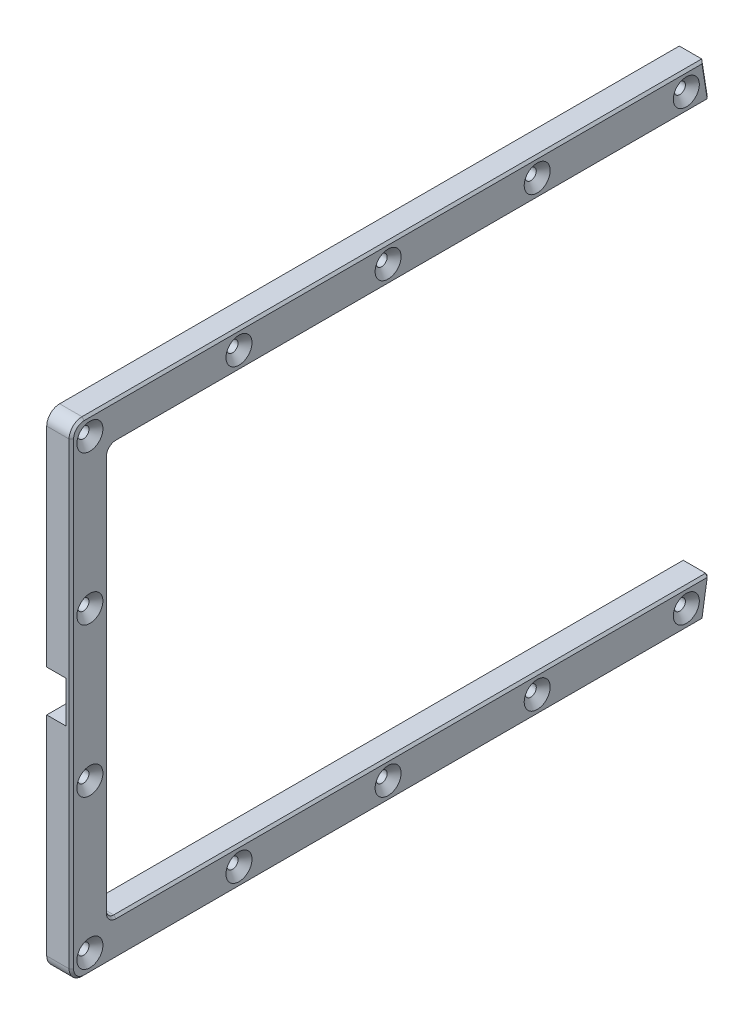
ISO-10303-21;
HEADER;
FILE_DESCRIPTION(('STEP AP214'),'2;1');
FILE_NAME('part.step','',(''),(''),'','','');
FILE_SCHEMA(('AUTOMOTIVE_DESIGN { 1 0 10303 214 1 1 1 1 }'));
ENDSEC;
DATA;
#1=APPLICATION_CONTEXT('core data for automotive mechanical design processes');
#2=APPLICATION_PROTOCOL_DEFINITION('international standard','automotive_design',2000,#1);
#3=PRODUCT_CONTEXT('',#1,'mechanical');
#4=PRODUCT('Part','Part','',(#3));
#5=PRODUCT_RELATED_PRODUCT_CATEGORY('part','',(#4));
#6=PRODUCT_DEFINITION_FORMATION('','',#4);
#7=PRODUCT_DEFINITION_CONTEXT('part definition',#1,'design');
#8=PRODUCT_DEFINITION('design','',#6,#7);
#9=PRODUCT_DEFINITION_SHAPE('','',#8);
#10=(LENGTH_UNIT() NAMED_UNIT(*) SI_UNIT(.MILLI.,.METRE.));
#11=(NAMED_UNIT(*) PLANE_ANGLE_UNIT() SI_UNIT($,.RADIAN.));
#12=(NAMED_UNIT(*) SI_UNIT($,.STERADIAN.) SOLID_ANGLE_UNIT());
#13=UNCERTAINTY_MEASURE_WITH_UNIT(LENGTH_MEASURE(1.E-05),#10,'distance_accuracy_value','');
#14=(GEOMETRIC_REPRESENTATION_CONTEXT(3) GLOBAL_UNCERTAINTY_ASSIGNED_CONTEXT((#13)) GLOBAL_UNIT_ASSIGNED_CONTEXT((#10,
#11,#12)) REPRESENTATION_CONTEXT('',''));
#15=CARTESIAN_POINT('',(0.,0.,0.));
#16=DIRECTION('',(0.,0.,1.));
#17=DIRECTION('',(1.,0.,0.));
#18=AXIS2_PLACEMENT_3D('',#15,#16,#17);
#19=CARTESIAN_POINT('',(8.382,104.069604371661,1.0615196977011));
#20=DIRECTION('',(-1.,0.,0.));
#21=DIRECTION('',(0.,0.,1.));
#22=AXIS2_PLACEMENT_3D('',#19,#20,#21);
#23=PLANE('',#22);
#24=CARTESIAN_POINT('',(8.382,-41.3961956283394,-9.75888030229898));
#25=DIRECTION('',(-1.,0.,0.));
#26=DIRECTION('',(0.,0.,1.));
#27=AXIS2_PLACEMENT_3D('',#24,#25,#26);
#28=CIRCLE('',#27,3.30200000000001);
#29=CARTESIAN_POINT('',(8.382,-44.6981956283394,-9.75888030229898));
#30=VERTEX_POINT('',#29);
#31=CARTESIAN_POINT('',(8.382,-41.3961956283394,-6.45688030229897));
#32=VERTEX_POINT('',#31);
#33=EDGE_CURVE('E513',#30,#32,#28,.T.);
#34=ORIENTED_EDGE('',*,*,#33,.T.);
#35=DIRECTION('',(0.,1.,0.));
#36=VECTOR('',#35,1.);
#37=CARTESIAN_POINT('',(8.382,104.069604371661,-6.45688030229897));
#38=LINE('',#37,#36);
#39=CARTESIAN_POINT('',(8.382,93.2238043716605,-6.45688030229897));
#40=VERTEX_POINT('',#39);
#41=EDGE_CURVE('E516',#32,#40,#38,.T.);
#42=ORIENTED_EDGE('',*,*,#41,.T.);
#43=CARTESIAN_POINT('',(8.382,93.2238043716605,-9.75888030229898));
#44=DIRECTION('',(-1.,0.,0.));
#45=DIRECTION('',(0.,0.,1.));
#46=AXIS2_PLACEMENT_3D('',#43,#44,#45);
#47=CIRCLE('',#46,3.30200000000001);
#48=CARTESIAN_POINT('',(8.382,96.5258043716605,-9.75888030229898));
#49=VERTEX_POINT('',#48);
#50=EDGE_CURVE('E510',#40,#49,#47,.T.);
#51=ORIENTED_EDGE('',*,*,#50,.T.);
#52=DIRECTION('',(0.,0.,-1.));
#53=VECTOR('',#52,1.);
#54=CARTESIAN_POINT('',(8.382,96.5258043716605,1.0615196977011));
#55=LINE('',#54,#53);
#56=CARTESIAN_POINT('',(8.382,96.5258043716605,-211.183486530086));
#57=VERTEX_POINT('',#56);
#58=EDGE_CURVE('E504',#49,#57,#55,.T.);
#59=ORIENTED_EDGE('',*,*,#58,.T.);
#60=DIRECTION('',(0.,0.987676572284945,0.156508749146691));
#61=VECTOR('',#60,1.);
#62=CARTESIAN_POINT('',(8.382,136.693657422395,-204.81842673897));
#63=LINE('',#62,#61);
#64=CARTESIAN_POINT('',(8.382,107.701804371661,-209.41252037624));
#65=VERTEX_POINT('',#64);
#66=EDGE_CURVE('E501',#57,#65,#63,.T.);
#67=ORIENTED_EDGE('',*,*,#66,.T.);
#68=DIRECTION('',(0.,0.,1.));
#69=VECTOR('',#68,1.);
#70=CARTESIAN_POINT('',(8.382,107.701804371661,1.0615196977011));
#71=LINE('',#70,#69);
#72=CARTESIAN_POINT('',(8.382,107.701804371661,1.0615196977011));
#73=VERTEX_POINT('',#72);
#74=EDGE_CURVE('E496',#65,#73,#71,.T.);
#75=ORIENTED_EDGE('',*,*,#74,.T.);
#76=CARTESIAN_POINT('',(8.382,104.069604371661,1.0615196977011));
#77=DIRECTION('',(-1.,0.,0.));
#78=DIRECTION('',(0.,0.,1.));
#79=AXIS2_PLACEMENT_3D('',#76,#77,#78);
#80=CIRCLE('',#79,3.63219999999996);
#81=CARTESIAN_POINT('',(8.382,104.069604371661,4.69371969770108));
#82=VERTEX_POINT('',#81);
#83=EDGE_CURVE('E490',#73,#82,#80,.F.);
#84=ORIENTED_EDGE('',*,*,#83,.T.);
#85=DIRECTION('',(0.,-1.,0.));
#86=VECTOR('',#85,1.);
#87=CARTESIAN_POINT('',(8.382,104.069604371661,4.69371969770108));
#88=LINE('',#87,#86);
#89=CARTESIAN_POINT('',(8.382,-52.2419956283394,4.69371969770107));
#90=VERTEX_POINT('',#89);
#91=EDGE_CURVE('E484',#82,#90,#88,.T.);
#92=ORIENTED_EDGE('',*,*,#91,.T.);
#93=CARTESIAN_POINT('',(8.382,-52.2419956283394,1.0615196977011));
#94=DIRECTION('',(-1.,0.,0.));
#95=DIRECTION('',(0.,0.,1.));
#96=AXIS2_PLACEMENT_3D('',#93,#94,#95);
#97=CIRCLE('',#96,3.63219999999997);
#98=CARTESIAN_POINT('',(8.382,-55.8741956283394,1.0615196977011));
#99=VERTEX_POINT('',#98);
#100=EDGE_CURVE('E487',#90,#99,#97,.F.);
#101=ORIENTED_EDGE('',*,*,#100,.T.);
#102=DIRECTION('',(0.,0.,-1.));
#103=VECTOR('',#102,1.);
#104=CARTESIAN_POINT('',(8.382,-55.8741956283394,1.0615196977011));
#105=LINE('',#104,#103);
#106=CARTESIAN_POINT('',(8.382,-55.8741956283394,-209.41252037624));
#107=VERTEX_POINT('',#106);
#108=EDGE_CURVE('E493',#99,#107,#105,.T.);
#109=ORIENTED_EDGE('',*,*,#108,.T.);
#110=DIRECTION('',(0.,0.987676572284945,-0.156508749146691));
#111=VECTOR('',#110,1.);
#112=CARTESIAN_POINT('',(8.382,67.6167004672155,-228.981077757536));
#113=LINE('',#112,#111);
#114=CARTESIAN_POINT('',(8.382,-44.6981956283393,-211.183486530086));
#115=VERTEX_POINT('',#114);
#116=EDGE_CURVE('E499',#107,#115,#113,.T.);
#117=ORIENTED_EDGE('',*,*,#116,.T.);
#118=DIRECTION('',(0.,0.,1.));
#119=VECTOR('',#118,1.);
#120=CARTESIAN_POINT('',(8.382,-44.6981956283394,1.06151969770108));
#121=LINE('',#120,#119);
#122=EDGE_CURVE('E507',#115,#30,#121,.T.);
#123=ORIENTED_EDGE('',*,*,#122,.T.);
#124=EDGE_LOOP('',(#34,#42,#51,#59,#67,#75,#84,#92,#101,#109,#117,#123));
#125=FACE_BOUND('',#124,.T.);
#126=CARTESIAN_POINT('',(8.382,102.113804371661,-204.068880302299));
#127=DIRECTION('',(-1.,0.,0.));
#128=DIRECTION('',(0.,0.,1.));
#129=AXIS2_PLACEMENT_3D('',#126,#127,#128);
#130=CIRCLE('',#129,4.4323);
#131=CARTESIAN_POINT('',(8.382,102.113804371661,-199.636580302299));
#132=VERTEX_POINT('',#131);
#133=EDGE_CURVE('E409',#132,#132,#130,.T.);
#134=ORIENTED_EDGE('',*,*,#133,.T.);
#135=EDGE_LOOP('',(#134));
#136=FACE_BOUND('',#135,.T.);
#137=CARTESIAN_POINT('',(8.382,102.113804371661,-153.268880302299));
#138=DIRECTION('',(-1.,0.,0.));
#139=DIRECTION('',(0.,0.,1.));
#140=AXIS2_PLACEMENT_3D('',#137,#138,#139);
#141=CIRCLE('',#140,4.4323);
#142=CARTESIAN_POINT('',(8.382,102.113804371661,-148.836580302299));
#143=VERTEX_POINT('',#142);
#144=EDGE_CURVE('E406',#143,#143,#141,.T.);
#145=ORIENTED_EDGE('',*,*,#144,.T.);
#146=EDGE_LOOP('',(#145));
#147=FACE_BOUND('',#146,.T.);
#148=CARTESIAN_POINT('',(8.382,102.113804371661,-102.468880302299));
#149=DIRECTION('',(-1.,0.,0.));
#150=DIRECTION('',(0.,0.,1.));
#151=AXIS2_PLACEMENT_3D('',#148,#149,#150);
#152=CIRCLE('',#151,4.43230000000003);
#153=CARTESIAN_POINT('',(8.382,102.113804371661,-98.0365803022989));
#154=VERTEX_POINT('',#153);
#155=EDGE_CURVE('E403',#154,#154,#152,.T.);
#156=ORIENTED_EDGE('',*,*,#155,.T.);
#157=EDGE_LOOP('',(#156));
#158=FACE_BOUND('',#157,.T.);
#159=CARTESIAN_POINT('',(8.382,102.113804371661,-51.6688803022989));
#160=DIRECTION('',(-1.,0.,0.));
#161=DIRECTION('',(0.,0.,1.));
#162=AXIS2_PLACEMENT_3D('',#159,#160,#161);
#163=CIRCLE('',#162,4.43230000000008);
#164=CARTESIAN_POINT('',(8.382,102.113804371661,-47.2365803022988));
#165=VERTEX_POINT('',#164);
#166=EDGE_CURVE('E400',#165,#165,#163,.T.);
#167=ORIENTED_EDGE('',*,*,#166,.T.);
#168=EDGE_LOOP('',(#167));
#169=FACE_BOUND('',#168,.T.);
#170=CARTESIAN_POINT('',(8.382,102.113804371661,-0.868880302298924));
#171=DIRECTION('',(-1.,0.,0.));
#172=DIRECTION('',(0.,0.,1.));
#173=AXIS2_PLACEMENT_3D('',#170,#171,#172);
#174=CIRCLE('',#173,4.43230000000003);
#175=CARTESIAN_POINT('',(8.382,102.113804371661,3.5634196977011));
#176=VERTEX_POINT('',#175);
#177=EDGE_CURVE('E396',#176,#176,#174,.T.);
#178=ORIENTED_EDGE('',*,*,#177,.T.);
#179=EDGE_LOOP('',(#178));
#180=FACE_BOUND('',#179,.T.);
#181=CARTESIAN_POINT('',(8.382,-50.2861956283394,-204.068880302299));
#182=DIRECTION('',(-1.,0.,0.));
#183=DIRECTION('',(0.,0.,1.));
#184=AXIS2_PLACEMENT_3D('',#181,#182,#183);
#185=CIRCLE('',#184,4.4323);
#186=CARTESIAN_POINT('',(8.382,-50.2861956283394,-199.636580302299));
#187=VERTEX_POINT('',#186);
#188=EDGE_CURVE('E393',#187,#187,#185,.T.);
#189=ORIENTED_EDGE('',*,*,#188,.T.);
#190=EDGE_LOOP('',(#189));
#191=FACE_BOUND('',#190,.T.);
#192=CARTESIAN_POINT('',(8.382,-50.2861956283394,-153.268880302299));
#193=DIRECTION('',(-1.,0.,0.));
#194=DIRECTION('',(0.,0.,1.));
#195=AXIS2_PLACEMENT_3D('',#192,#193,#194);
#196=CIRCLE('',#195,4.4323);
#197=CARTESIAN_POINT('',(8.382,-50.2861956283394,-148.836580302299));
#198=VERTEX_POINT('',#197);
#199=EDGE_CURVE('E390',#198,#198,#196,.T.);
#200=ORIENTED_EDGE('',*,*,#199,.T.);
#201=EDGE_LOOP('',(#200));
#202=FACE_BOUND('',#201,.T.);
#203=CARTESIAN_POINT('',(8.382,-50.2861956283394,-102.468880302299));
#204=DIRECTION('',(-1.,0.,0.));
#205=DIRECTION('',(0.,0.,1.));
#206=AXIS2_PLACEMENT_3D('',#203,#204,#205);
#207=CIRCLE('',#206,4.43230000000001);
#208=CARTESIAN_POINT('',(8.382,-50.2861956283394,-98.0365803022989));
#209=VERTEX_POINT('',#208);
#210=EDGE_CURVE('E387',#209,#209,#207,.T.);
#211=ORIENTED_EDGE('',*,*,#210,.T.);
#212=EDGE_LOOP('',(#211));
#213=FACE_BOUND('',#212,.T.);
#214=CARTESIAN_POINT('',(8.382,-50.2861956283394,-51.6688803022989));
#215=DIRECTION('',(-1.,0.,0.));
#216=DIRECTION('',(0.,0.,1.));
#217=AXIS2_PLACEMENT_3D('',#214,#215,#216);
#218=CIRCLE('',#217,4.4323);
#219=CARTESIAN_POINT('',(8.382,-50.2861956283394,-47.2365803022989));
#220=VERTEX_POINT('',#219);
#221=EDGE_CURVE('E384',#220,#220,#218,.T.);
#222=ORIENTED_EDGE('',*,*,#221,.T.);
#223=EDGE_LOOP('',(#222));
#224=FACE_BOUND('',#223,.T.);
#225=CARTESIAN_POINT('',(8.382,-50.2861956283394,-0.868880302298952));
#226=DIRECTION('',(-1.,0.,0.));
#227=DIRECTION('',(0.,0.,1.));
#228=AXIS2_PLACEMENT_3D('',#225,#226,#227);
#229=CIRCLE('',#228,4.43230000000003);
#230=CARTESIAN_POINT('',(8.382,-50.2861956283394,3.56341969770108));
#231=VERTEX_POINT('',#230);
#232=EDGE_CURVE('E380',#231,#231,#229,.T.);
#233=ORIENTED_EDGE('',*,*,#232,.T.);
#234=EDGE_LOOP('',(#233));
#235=FACE_BOUND('',#234,.T.);
#236=CARTESIAN_POINT('',(8.382,0.51380437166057,-0.868880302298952));
#237=DIRECTION('',(-1.,0.,0.));
#238=DIRECTION('',(0.,0.,1.));
#239=AXIS2_PLACEMENT_3D('',#236,#237,#238);
#240=CIRCLE('',#239,4.4323);
#241=CARTESIAN_POINT('',(8.382,0.51380437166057,3.56341969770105));
#242=VERTEX_POINT('',#241);
#243=EDGE_CURVE('E376',#242,#242,#240,.T.);
#244=ORIENTED_EDGE('',*,*,#243,.T.);
#245=EDGE_LOOP('',(#244));
#246=FACE_BOUND('',#245,.T.);
#247=CARTESIAN_POINT('',(8.382,51.3138043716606,-0.868880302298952));
#248=DIRECTION('',(-1.,0.,0.));
#249=DIRECTION('',(0.,0.,1.));
#250=AXIS2_PLACEMENT_3D('',#247,#248,#249);
#251=CIRCLE('',#250,4.43230000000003);
#252=CARTESIAN_POINT('',(8.382,51.3138043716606,3.56341969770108));
#253=VERTEX_POINT('',#252);
#254=EDGE_CURVE('E372',#253,#253,#251,.T.);
#255=ORIENTED_EDGE('',*,*,#254,.T.);
#256=EDGE_LOOP('',(#255));
#257=FACE_BOUND('',#256,.T.);
#258=ADVANCED_FACE('F38',(#125,#136,#147,#158,#169,#180,#191,#202,#213,#224,#235,#246,#257),#23,.F.);
#259=CARTESIAN_POINT('',(0.,104.069604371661,1.0615196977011));
#260=DIRECTION('',(-1.,0.,0.));
#261=DIRECTION('',(0.,0.,1.));
#262=AXIS2_PLACEMENT_3D('',#259,#260,#261);
#263=PLANE('',#262);
#264=DIRECTION('',(0.,0.987676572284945,0.156508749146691));
#265=VECTOR('',#264,1.);
#266=CARTESIAN_POINT('',(0.,95.7638043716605,-212.07574184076));
#267=LINE('',#266,#265);
#268=CARTESIAN_POINT('',(0.,96.4215732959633,-211.971510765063));
#269=VERTEX_POINT('',#268);
#270=CARTESIAN_POINT('',(0.,108.463804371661,-210.063280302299));
#271=VERTEX_POINT('',#270);
#272=EDGE_CURVE('E330',#269,#271,#267,.T.);
#273=ORIENTED_EDGE('',*,*,#272,.F.);
#274=DIRECTION('',(0.,0.707106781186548,-0.707106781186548));
#275=VECTOR('',#274,1.);
#276=CARTESIAN_POINT('',(0.,-6.27092639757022,-109.27901107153));
#277=LINE('',#276,#275);
#278=CARTESIAN_POINT('',(0.,95.7638043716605,-211.31374184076));
#279=VERTEX_POINT('',#278);
#280=EDGE_CURVE('E477',#269,#279,#277,.F.);
#281=ORIENTED_EDGE('',*,*,#280,.T.);
#282=DIRECTION('',(0.,0.,-1.));
#283=VECTOR('',#282,1.);
#284=CARTESIAN_POINT('',(0.,95.7638043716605,-7.21888030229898));
#285=LINE('',#284,#283);
#286=CARTESIAN_POINT('',(0.,95.7638043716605,-9.75888030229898));
#287=VERTEX_POINT('',#286);
#288=EDGE_CURVE('E326',#287,#279,#285,.T.);
#289=ORIENTED_EDGE('',*,*,#288,.F.);
#290=CARTESIAN_POINT('',(0.,93.2238043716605,-9.75888030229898));
#291=DIRECTION('',(-1.,0.,0.));
#292=DIRECTION('',(0.,0.,1.));
#293=AXIS2_PLACEMENT_3D('',#290,#291,#292);
#294=CIRCLE('',#293,2.54);
#295=CARTESIAN_POINT('',(0.,93.2238043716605,-7.21888030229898));
#296=VERTEX_POINT('',#295);
#297=EDGE_CURVE('E463',#287,#296,#294,.F.);
#298=ORIENTED_EDGE('',*,*,#297,.T.);
#299=DIRECTION('',(0.,1.,0.));
#300=VECTOR('',#299,1.);
#301=CARTESIAN_POINT('',(0.,-43.9361956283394,-7.21888030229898));
#302=LINE('',#301,#300);
#303=CARTESIAN_POINT('',(0.,-41.3961956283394,-7.21888030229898));
#304=VERTEX_POINT('',#303);
#305=EDGE_CURVE('E322',#304,#296,#302,.T.);
#306=ORIENTED_EDGE('',*,*,#305,.F.);
#307=CARTESIAN_POINT('',(0.,-41.3961956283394,-9.75888030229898));
#308=DIRECTION('',(-1.,0.,0.));
#309=DIRECTION('',(0.,0.,1.));
#310=AXIS2_PLACEMENT_3D('',#307,#308,#309);
#311=CIRCLE('',#310,2.54);
#312=CARTESIAN_POINT('',(0.,-43.9361956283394,-9.75888030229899));
#313=VERTEX_POINT('',#312);
#314=EDGE_CURVE('E466',#304,#313,#311,.F.);
#315=ORIENTED_EDGE('',*,*,#314,.T.);
#316=DIRECTION('',(0.,0.,1.));
#317=VECTOR('',#316,1.);
#318=CARTESIAN_POINT('',(0.,-43.9361956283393,-212.07574184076));
#319=LINE('',#318,#317);
#320=CARTESIAN_POINT('',(0.,-43.9361956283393,-211.40976580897));
#321=VERTEX_POINT('',#320);
#322=EDGE_CURVE('E319',#321,#313,#319,.T.);
#323=ORIENTED_EDGE('',*,*,#322,.F.);
#324=DIRECTION('',(0.,0.809061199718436,0.587724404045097));
#325=VECTOR('',#324,1.);
#326=CARTESIAN_POINT('',(0.,153.976605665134,-67.6404400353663));
#327=LINE('',#326,#325);
#328=CARTESIAN_POINT('',(0.,-44.6888051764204,-211.956482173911));
#329=VERTEX_POINT('',#328);
#330=EDGE_CURVE('E475',#321,#329,#327,.F.);
#331=ORIENTED_EDGE('',*,*,#330,.T.);
#332=DIRECTION('',(0.,0.987676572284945,-0.156508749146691));
#333=VECTOR('',#332,1.);
#334=CARTESIAN_POINT('',(0.,-56.6361956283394,-210.063280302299));
#335=LINE('',#334,#333);
#336=CARTESIAN_POINT('',(0.,-56.6361956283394,-210.063280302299));
#337=VERTEX_POINT('',#336);
#338=EDGE_CURVE('E316',#337,#329,#335,.T.);
#339=ORIENTED_EDGE('',*,*,#338,.F.);
#340=DIRECTION('',(0.,0.,-1.));
#341=VECTOR('',#340,1.);
#342=CARTESIAN_POINT('',(0.,-56.6361956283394,1.0615196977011));
#343=LINE('',#342,#341);
#344=CARTESIAN_POINT('',(0.,-56.6361956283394,1.0615196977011));
#345=VERTEX_POINT('',#344);
#346=EDGE_CURVE('E349',#345,#337,#343,.T.);
#347=ORIENTED_EDGE('',*,*,#346,.F.);
#348=CARTESIAN_POINT('',(0.,-52.2419956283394,1.0615196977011));
#349=DIRECTION('',(1.,0.,0.));
#350=DIRECTION('',(0.,0.,-1.));
#351=AXIS2_PLACEMENT_3D('',#348,#349,#350);
#352=CIRCLE('',#351,4.39419999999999);
#353=CARTESIAN_POINT('',(0.,-52.2419956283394,5.45571969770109));
#354=VERTEX_POINT('',#353);
#355=EDGE_CURVE('E345',#354,#345,#352,.T.);
#356=ORIENTED_EDGE('',*,*,#355,.F.);
#357=DIRECTION('',(0.,-1.,0.));
#358=VECTOR('',#357,1.);
#359=CARTESIAN_POINT('',(0.,104.069604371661,5.4557196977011));
#360=LINE('',#359,#358);
#361=CARTESIAN_POINT('',(0.,18.8589543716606,5.45571969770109));
#362=VERTEX_POINT('',#361);
#363=EDGE_CURVE('E341',#362,#354,#360,.T.);
#364=ORIENTED_EDGE('',*,*,#363,.F.);
#365=DIRECTION('',(0.,0.,1.));
#366=VECTOR('',#365,1.);
#367=CARTESIAN_POINT('',(0.,18.8589543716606,-22.7548012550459));
#368=LINE('',#367,#366);
#369=CARTESIAN_POINT('',(0.,18.8589543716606,-4.64888026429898));
#370=VERTEX_POINT('',#369);
#371=EDGE_CURVE('E245',#370,#362,#368,.T.);
#372=ORIENTED_EDGE('',*,*,#371,.F.);
#373=DIRECTION('',(0.,1.,0.));
#374=VECTOR('',#373,1.);
#375=CARTESIAN_POINT('',(0.,32.9686543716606,-4.64888026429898));
#376=LINE('',#375,#374);
#377=CARTESIAN_POINT('',(0.,32.9686543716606,-4.64888026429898));
#378=VERTEX_POINT('',#377);
#379=EDGE_CURVE('E276',#370,#378,#376,.T.);
#380=ORIENTED_EDGE('',*,*,#379,.T.);
#381=DIRECTION('',(0.,0.,1.));
#382=VECTOR('',#381,1.);
#383=CARTESIAN_POINT('',(0.,32.9686543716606,-22.7548012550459));
#384=LINE('',#383,#382);
#385=CARTESIAN_POINT('',(0.,32.9686543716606,5.45571969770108));
#386=VERTEX_POINT('',#385);
#387=EDGE_CURVE('E265',#378,#386,#384,.T.);
#388=ORIENTED_EDGE('',*,*,#387,.T.);
#389=CARTESIAN_POINT('',(0.,104.069604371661,5.4557196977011));
#390=VERTEX_POINT('',#389);
#391=EDGE_CURVE('E342',#390,#386,#360,.T.);
#392=ORIENTED_EDGE('',*,*,#391,.F.);
#393=CARTESIAN_POINT('',(0.,104.069604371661,1.0615196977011));
#394=DIRECTION('',(1.,0.,0.));
#395=DIRECTION('',(0.,0.,1.));
#396=AXIS2_PLACEMENT_3D('',#393,#394,#395);
#397=CIRCLE('',#396,4.39419999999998);
#398=CARTESIAN_POINT('',(0.,108.463804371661,1.0615196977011));
#399=VERTEX_POINT('',#398);
#400=EDGE_CURVE('E337',#399,#390,#397,.T.);
#401=ORIENTED_EDGE('',*,*,#400,.F.);
#402=DIRECTION('',(0.,0.,1.));
#403=VECTOR('',#402,1.);
#404=CARTESIAN_POINT('',(0.,108.463804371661,-210.063280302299));
#405=LINE('',#404,#403);
#406=EDGE_CURVE('E333',#271,#399,#405,.T.);
#407=ORIENTED_EDGE('',*,*,#406,.F.);
#408=EDGE_LOOP('',(#273,#281,#289,#298,#306,#315,#323,#331,#339,#347,#356,#364,#372,#380,#388,
#392,#401,#407));
#409=FACE_BOUND('',#408,.T.);
#410=CARTESIAN_POINT('',(0.,102.113804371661,-153.268880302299));
#411=DIRECTION('',(1.,0.,0.));
#412=DIRECTION('',(0.,0.,-1.));
#413=AXIS2_PLACEMENT_3D('',#410,#411,#412);
#414=CIRCLE('',#413,1.89230000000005);
#415=CARTESIAN_POINT('',(0.,102.113804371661,-155.161180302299));
#416=VERTEX_POINT('',#415);
#417=EDGE_CURVE('E279',#416,#416,#414,.T.);
#418=ORIENTED_EDGE('',*,*,#417,.T.);
#419=EDGE_LOOP('',(#418));
#420=FACE_BOUND('',#419,.T.);
#421=CARTESIAN_POINT('',(0.,102.113804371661,-0.868880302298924));
#422=DIRECTION('',(1.,0.,0.));
#423=DIRECTION('',(0.,0.,-1.));
#424=AXIS2_PLACEMENT_3D('',#421,#422,#423);
#425=CIRCLE('',#424,1.89230000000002);
#426=CARTESIAN_POINT('',(0.,102.113804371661,-2.76118030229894));
#427=VERTEX_POINT('',#426);
#428=EDGE_CURVE('E285',#427,#427,#425,.T.);
#429=ORIENTED_EDGE('',*,*,#428,.T.);
#430=EDGE_LOOP('',(#429));
#431=FACE_BOUND('',#430,.T.);
#432=CARTESIAN_POINT('',(0.,0.51380437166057,-0.868880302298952));
#433=DIRECTION('',(1.,0.,0.));
#434=DIRECTION('',(0.,0.,-1.));
#435=AXIS2_PLACEMENT_3D('',#432,#433,#434);
#436=CIRCLE('',#435,1.89230000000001);
#437=CARTESIAN_POINT('',(0.,0.51380437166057,-2.76118030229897));
#438=VERTEX_POINT('',#437);
#439=EDGE_CURVE('E293',#438,#438,#436,.T.);
#440=ORIENTED_EDGE('',*,*,#439,.T.);
#441=EDGE_LOOP('',(#440));
#442=FACE_BOUND('',#441,.T.);
#443=CARTESIAN_POINT('',(0.,-50.2861956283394,-102.468880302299));
#444=DIRECTION('',(1.,0.,0.));
#445=DIRECTION('',(0.,0.,-1.));
#446=AXIS2_PLACEMENT_3D('',#443,#444,#445);
#447=CIRCLE('',#446,1.89230000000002);
#448=CARTESIAN_POINT('',(0.,-50.2861956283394,-104.361180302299));
#449=VERTEX_POINT('',#448);
#450=EDGE_CURVE('E301',#449,#449,#447,.T.);
#451=ORIENTED_EDGE('',*,*,#450,.T.);
#452=EDGE_LOOP('',(#451));
#453=FACE_BOUND('',#452,.T.);
#454=CARTESIAN_POINT('',(0.,-50.2861956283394,-204.068880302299));
#455=DIRECTION('',(1.,0.,0.));
#456=DIRECTION('',(0.,0.,-1.));
#457=AXIS2_PLACEMENT_3D('',#454,#455,#456);
#458=CIRCLE('',#457,1.89230000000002);
#459=CARTESIAN_POINT('',(0.,-50.2861956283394,-205.961180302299));
#460=VERTEX_POINT('',#459);
#461=EDGE_CURVE('E307',#460,#460,#458,.T.);
#462=ORIENTED_EDGE('',*,*,#461,.T.);
#463=EDGE_LOOP('',(#462));
#464=FACE_BOUND('',#463,.T.);
#465=CARTESIAN_POINT('',(0.,-50.2861956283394,-153.268880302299));
#466=DIRECTION('',(1.,0.,0.));
#467=DIRECTION('',(0.,0.,-1.));
#468=AXIS2_PLACEMENT_3D('',#465,#466,#467);
#469=CIRCLE('',#468,1.89230000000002);
#470=CARTESIAN_POINT('',(0.,-50.2861956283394,-155.161180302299));
#471=VERTEX_POINT('',#470);
#472=EDGE_CURVE('E313',#471,#471,#469,.T.);
#473=ORIENTED_EDGE('',*,*,#472,.T.);
#474=EDGE_LOOP('',(#473));
#475=FACE_BOUND('',#474,.T.);
#476=CARTESIAN_POINT('',(0.,-50.2861956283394,-51.6688803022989));
#477=DIRECTION('',(1.,0.,0.));
#478=DIRECTION('',(0.,0.,-1.));
#479=AXIS2_PLACEMENT_3D('',#476,#477,#478);
#480=CIRCLE('',#479,1.89230000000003);
#481=CARTESIAN_POINT('',(0.,-50.2861956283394,-53.561180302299));
#482=VERTEX_POINT('',#481);
#483=EDGE_CURVE('E310',#482,#482,#480,.T.);
#484=ORIENTED_EDGE('',*,*,#483,.T.);
#485=EDGE_LOOP('',(#484));
#486=FACE_BOUND('',#485,.T.);
#487=CARTESIAN_POINT('',(0.,102.113804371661,-51.6688803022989));
#488=DIRECTION('',(1.,0.,0.));
#489=DIRECTION('',(0.,0.,-1.));
#490=AXIS2_PLACEMENT_3D('',#487,#488,#489);
#491=CIRCLE('',#490,1.89230000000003);
#492=CARTESIAN_POINT('',(0.,102.113804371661,-53.561180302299));
#493=VERTEX_POINT('',#492);
#494=EDGE_CURVE('E304',#493,#493,#491,.T.);
#495=ORIENTED_EDGE('',*,*,#494,.T.);
#496=EDGE_LOOP('',(#495));
#497=FACE_BOUND('',#496,.T.);
#498=CARTESIAN_POINT('',(0.,-50.2861956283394,-0.868880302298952));
#499=DIRECTION('',(1.,0.,0.));
#500=DIRECTION('',(0.,0.,-1.));
#501=AXIS2_PLACEMENT_3D('',#498,#499,#500);
#502=CIRCLE('',#501,1.89230000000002);
#503=CARTESIAN_POINT('',(0.,-50.2861956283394,-2.76118030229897));
#504=VERTEX_POINT('',#503);
#505=EDGE_CURVE('E297',#504,#504,#502,.T.);
#506=ORIENTED_EDGE('',*,*,#505,.T.);
#507=EDGE_LOOP('',(#506));
#508=FACE_BOUND('',#507,.T.);
#509=CARTESIAN_POINT('',(0.,51.3138043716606,-0.868880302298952));
#510=DIRECTION('',(1.,0.,0.));
#511=DIRECTION('',(0.,0.,-1.));
#512=AXIS2_PLACEMENT_3D('',#509,#510,#511);
#513=CIRCLE('',#512,1.89230000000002);
#514=CARTESIAN_POINT('',(0.,51.3138043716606,-2.76118030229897));
#515=VERTEX_POINT('',#514);
#516=EDGE_CURVE('E289',#515,#515,#513,.T.);
#517=ORIENTED_EDGE('',*,*,#516,.T.);
#518=EDGE_LOOP('',(#517));
#519=FACE_BOUND('',#518,.T.);
#520=CARTESIAN_POINT('',(0.,102.113804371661,-102.468880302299));
#521=DIRECTION('',(1.,0.,0.));
#522=DIRECTION('',(0.,0.,-1.));
#523=AXIS2_PLACEMENT_3D('',#520,#521,#522);
#524=CIRCLE('',#523,1.89230000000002);
#525=CARTESIAN_POINT('',(0.,102.113804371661,-104.361180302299));
#526=VERTEX_POINT('',#525);
#527=EDGE_CURVE('E282',#526,#526,#524,.T.);
#528=ORIENTED_EDGE('',*,*,#527,.T.);
#529=EDGE_LOOP('',(#528));
#530=FACE_BOUND('',#529,.T.);
#531=CARTESIAN_POINT('',(0.,102.113804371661,-204.068880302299));
#532=DIRECTION('',(1.,0.,0.));
#533=DIRECTION('',(0.,0.,-1.));
#534=AXIS2_PLACEMENT_3D('',#531,#532,#533);
#535=CIRCLE('',#534,1.89230000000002);
#536=CARTESIAN_POINT('',(0.,102.113804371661,-205.961180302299));
#537=VERTEX_POINT('',#536);
#538=EDGE_CURVE('E275',#537,#537,#535,.T.);
#539=ORIENTED_EDGE('',*,*,#538,.T.);
#540=EDGE_LOOP('',(#539));
#541=FACE_BOUND('',#540,.T.);
#542=ADVANCED_FACE('F633',(#409,#420,#431,#442,#453,#464,#475,#486,#497,#508,#519,#530,#541),
#263,.T.);
#543=CARTESIAN_POINT('',(8.382,-56.6361956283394,-210.063280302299));
#544=DIRECTION('',(0.,0.156508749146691,0.987676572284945));
#545=DIRECTION('',(0.,-0.987676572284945,0.156508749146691));
#546=AXIS2_PLACEMENT_3D('',#543,#544,#545);
#547=PLANE('',#546);
#548=ORIENTED_EDGE('',*,*,#338,.T.);
#549=DIRECTION('',(1.,0.,0.));
#550=VECTOR('',#549,1.);
#551=CARTESIAN_POINT('',(8.382,-44.6888051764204,-211.956482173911));
#552=LINE('',#551,#550);
#553=CARTESIAN_POINT('',(7.61999999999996,-44.6888051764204,-211.956482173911));
#554=VERTEX_POINT('',#553);
#555=EDGE_CURVE('E526',#329,#554,#552,.T.);
#556=ORIENTED_EDGE('',*,*,#555,.T.);
#557=DIRECTION('',(0.,-0.987676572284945,0.156508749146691));
#558=VECTOR('',#557,1.);
#559=CARTESIAN_POINT('',(7.61999999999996,-56.6361956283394,-210.063280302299));
#560=LINE('',#559,#558);
#561=CARTESIAN_POINT('',(7.61999999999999,-56.6361956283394,-210.063280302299));
#562=VERTEX_POINT('',#561);
#563=EDGE_CURVE('E524',#554,#562,#560,.T.);
#564=ORIENTED_EDGE('',*,*,#563,.T.);
#565=DIRECTION('',(-1.,0.,0.));
#566=VECTOR('',#565,1.);
#567=CARTESIAN_POINT('',(8.382,-56.6361956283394,-210.063280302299));
#568=LINE('',#567,#566);
#569=EDGE_CURVE('E353',#562,#337,#568,.T.);
#570=ORIENTED_EDGE('',*,*,#569,.T.);
#571=EDGE_LOOP('',(#548,#556,#564,#570));
#572=FACE_BOUND('',#571,.T.);
#573=ADVANCED_FACE('F625',(#572),#547,.F.);
#574=CARTESIAN_POINT('',(8.382,-43.9361956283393,-212.07574184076));
#575=DIRECTION('',(0.,-1.,0.));
#576=DIRECTION('',(0.,0.,-1.));
#577=AXIS2_PLACEMENT_3D('',#574,#575,#576);
#578=PLANE('',#577);
#579=DIRECTION('',(0.,0.,-1.));
#580=VECTOR('',#579,1.);
#581=CARTESIAN_POINT('',(7.61999999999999,-43.9361956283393,-212.07574184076));
#582=LINE('',#581,#580);
#583=CARTESIAN_POINT('',(7.61999999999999,-43.9361956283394,-9.75888030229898));
#584=VERTEX_POINT('',#583);
#585=CARTESIAN_POINT('',(7.61999999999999,-43.9361956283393,-211.40976580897));
#586=VERTEX_POINT('',#585);
#587=EDGE_CURVE('E519',#584,#586,#582,.T.);
#588=ORIENTED_EDGE('',*,*,#587,.T.);
#589=DIRECTION('',(-1.,0.,0.));
#590=VECTOR('',#589,1.);
#591=CARTESIAN_POINT('',(8.382,-43.9361956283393,-211.40976580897));
#592=LINE('',#591,#590);
#593=EDGE_CURVE('E522',#586,#321,#592,.T.);
#594=ORIENTED_EDGE('',*,*,#593,.T.);
#595=ORIENTED_EDGE('',*,*,#322,.T.);
#596=DIRECTION('',(-1.,0.,0.));
#597=VECTOR('',#596,1.);
#598=CARTESIAN_POINT('',(8.382,-43.9361956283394,-9.75888030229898));
#599=LINE('',#598,#597);
#600=EDGE_CURVE('E459',#313,#584,#599,.F.);
#601=ORIENTED_EDGE('',*,*,#600,.T.);
#602=EDGE_LOOP('',(#588,#594,#595,#601));
#603=FACE_BOUND('',#602,.T.);
#604=ADVANCED_FACE('F638',(#603),#578,.F.);
#605=CARTESIAN_POINT('',(8.382,-43.9361956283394,-7.21888030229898));
#606=DIRECTION('',(0.,0.,1.));
#607=DIRECTION('',(0.,-1.,0.));
#608=AXIS2_PLACEMENT_3D('',#605,#606,#607);
#609=PLANE('',#608);
#610=DIRECTION('',(-1.,0.,0.));
#611=VECTOR('',#610,1.);
#612=CARTESIAN_POINT('',(8.382,93.2238043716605,-7.21888030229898));
#613=LINE('',#612,#611);
#614=CARTESIAN_POINT('',(7.61999999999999,93.2238043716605,-7.21888030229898));
#615=VERTEX_POINT('',#614);
#616=EDGE_CURVE('E455',#296,#615,#613,.F.);
#617=ORIENTED_EDGE('',*,*,#616,.T.);
#618=DIRECTION('',(0.,-1.,0.));
#619=VECTOR('',#618,1.);
#620=CARTESIAN_POINT('',(7.61999999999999,-43.9361956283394,-7.21888030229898));
#621=LINE('',#620,#619);
#622=CARTESIAN_POINT('',(7.61999999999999,-41.3961956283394,-7.21888030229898));
#623=VERTEX_POINT('',#622);
#624=EDGE_CURVE('E534',#615,#623,#621,.T.);
#625=ORIENTED_EDGE('',*,*,#624,.T.);
#626=DIRECTION('',(-1.,0.,0.));
#627=VECTOR('',#626,1.);
#628=CARTESIAN_POINT('',(0.,-41.3961956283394,-7.21888030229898));
#629=LINE('',#628,#627);
#630=EDGE_CURVE('E452',#623,#304,#629,.T.);
#631=ORIENTED_EDGE('',*,*,#630,.T.);
#632=ORIENTED_EDGE('',*,*,#305,.T.);
#633=EDGE_LOOP('',(#617,#625,#631,#632));
#634=FACE_BOUND('',#633,.T.);
#635=ADVANCED_FACE('F738',(#634),#609,.F.);
#636=CARTESIAN_POINT('',(8.382,95.7638043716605,-7.21888030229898));
#637=DIRECTION('',(0.,1.,0.));
#638=DIRECTION('',(0.,0.,1.));
#639=AXIS2_PLACEMENT_3D('',#636,#637,#638);
#640=PLANE('',#639);
#641=ORIENTED_EDGE('',*,*,#288,.T.);
#642=DIRECTION('',(1.,0.,0.));
#643=VECTOR('',#642,1.);
#644=CARTESIAN_POINT('',(8.382,95.7638043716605,-211.31374184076));
#645=LINE('',#644,#643);
#646=CARTESIAN_POINT('',(7.61999999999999,95.7638043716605,-211.31374184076));
#647=VERTEX_POINT('',#646);
#648=EDGE_CURVE('E482',#279,#647,#645,.T.);
#649=ORIENTED_EDGE('',*,*,#648,.T.);
#650=DIRECTION('',(0.,0.,1.));
#651=VECTOR('',#650,1.);
#652=CARTESIAN_POINT('',(7.61999999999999,95.7638043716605,-7.21888030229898));
#653=LINE('',#652,#651);
#654=CARTESIAN_POINT('',(7.61999999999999,95.7638043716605,-9.75888030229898));
#655=VERTEX_POINT('',#654);
#656=EDGE_CURVE('E479',#647,#655,#653,.T.);
#657=ORIENTED_EDGE('',*,*,#656,.T.);
#658=DIRECTION('',(-1.,0.,0.));
#659=VECTOR('',#658,1.);
#660=CARTESIAN_POINT('',(0.,95.7638043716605,-9.75888030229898));
#661=LINE('',#660,#659);
#662=EDGE_CURVE('E449',#655,#287,#661,.T.);
#663=ORIENTED_EDGE('',*,*,#662,.T.);
#664=EDGE_LOOP('',(#641,#649,#657,#663));
#665=FACE_BOUND('',#664,.T.);
#666=ADVANCED_FACE('F735',(#665),#640,.F.);
#667=CARTESIAN_POINT('',(8.382,95.7638043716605,-212.07574184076));
#668=DIRECTION('',(0.,-0.156508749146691,0.987676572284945));
#669=DIRECTION('',(0.,-0.987676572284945,-0.156508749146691));
#670=AXIS2_PLACEMENT_3D('',#667,#668,#669);
#671=PLANE('',#670);
#672=DIRECTION('',(0.,-0.987676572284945,-0.156508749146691));
#673=VECTOR('',#672,1.);
#674=CARTESIAN_POINT('',(7.61999999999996,95.7638043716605,-212.07574184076));
#675=LINE('',#674,#673);
#676=CARTESIAN_POINT('',(7.61999999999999,108.463804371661,-210.063280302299));
#677=VERTEX_POINT('',#676);
#678=CARTESIAN_POINT('',(7.61999999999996,96.4215732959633,-211.971510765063));
#679=VERTEX_POINT('',#678);
#680=EDGE_CURVE('E470',#677,#679,#675,.T.);
#681=ORIENTED_EDGE('',*,*,#680,.T.);
#682=DIRECTION('',(-1.,0.,0.));
#683=VECTOR('',#682,1.);
#684=CARTESIAN_POINT('',(8.382,96.4215732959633,-211.971510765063));
#685=LINE('',#684,#683);
#686=EDGE_CURVE('E472',#679,#269,#685,.T.);
#687=ORIENTED_EDGE('',*,*,#686,.T.);
#688=ORIENTED_EDGE('',*,*,#272,.T.);
#689=DIRECTION('',(-1.,0.,0.));
#690=VECTOR('',#689,1.);
#691=CARTESIAN_POINT('',(8.382,108.463804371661,-210.063280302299));
#692=LINE('',#691,#690);
#693=EDGE_CURVE('E367',#677,#271,#692,.T.);
#694=ORIENTED_EDGE('',*,*,#693,.F.);
#695=EDGE_LOOP('',(#681,#687,#688,#694));
#696=FACE_BOUND('',#695,.T.);
#697=ADVANCED_FACE('F689',(#696),#671,.F.);
#698=CARTESIAN_POINT('',(8.382,108.463804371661,-210.063280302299));
#699=DIRECTION('',(0.,-1.,0.));
#700=DIRECTION('',(0.,0.,-1.));
#701=AXIS2_PLACEMENT_3D('',#698,#699,#700);
#702=PLANE('',#701);
#703=DIRECTION('',(-1.,0.,0.));
#704=VECTOR('',#703,1.);
#705=CARTESIAN_POINT('',(8.382,108.463804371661,1.0615196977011));
#706=LINE('',#705,#704);
#707=CARTESIAN_POINT('',(7.61999999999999,108.463804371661,1.0615196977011));
#708=VERTEX_POINT('',#707);
#709=EDGE_CURVE('E364',#708,#399,#706,.T.);
#710=ORIENTED_EDGE('',*,*,#709,.F.);
#711=DIRECTION('',(0.,0.,-1.));
#712=VECTOR('',#711,1.);
#713=CARTESIAN_POINT('',(7.61999999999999,108.463804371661,-210.063280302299));
#714=LINE('',#713,#712);
#715=EDGE_CURVE('E537',#708,#677,#714,.T.);
#716=ORIENTED_EDGE('',*,*,#715,.T.);
#717=ORIENTED_EDGE('',*,*,#693,.T.);
#718=ORIENTED_EDGE('',*,*,#406,.T.);
#719=EDGE_LOOP('',(#710,#716,#717,#718));
#720=FACE_BOUND('',#719,.T.);
#721=ADVANCED_FACE('F687',(#720),#702,.F.);
#722=CARTESIAN_POINT('',(8.382,104.069604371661,1.0615196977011));
#723=DIRECTION('',(-1.,0.,0.));
#724=DIRECTION('',(0.,0.,1.));
#725=AXIS2_PLACEMENT_3D('',#722,#723,#724);
#726=CYLINDRICAL_SURFACE('',#725,4.39419999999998);
#727=DIRECTION('',(-1.,0.,0.));
#728=VECTOR('',#727,1.);
#729=CARTESIAN_POINT('',(8.382,104.069604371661,5.4557196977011));
#730=LINE('',#729,#728);
#731=CARTESIAN_POINT('',(7.61999999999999,104.069604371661,5.4557196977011));
#732=VERTEX_POINT('',#731);
#733=EDGE_CURVE('E361',#732,#390,#730,.T.);
#734=ORIENTED_EDGE('',*,*,#733,.F.);
#735=CARTESIAN_POINT('',(7.61999999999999,104.069604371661,1.0615196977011));
#736=DIRECTION('',(-1.,0.,0.));
#737=DIRECTION('',(0.,0.,1.));
#738=AXIS2_PLACEMENT_3D('',#735,#736,#737);
#739=CIRCLE('',#738,4.39419999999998);
#740=EDGE_CURVE('E543',#732,#708,#739,.T.);
#741=ORIENTED_EDGE('',*,*,#740,.T.);
#742=ORIENTED_EDGE('',*,*,#709,.T.);
#743=ORIENTED_EDGE('',*,*,#400,.T.);
#744=EDGE_LOOP('',(#734,#741,#742,#743));
#745=FACE_BOUND('',#744,.T.);
#746=ADVANCED_FACE('F694',(#745),#726,.T.);
#747=CARTESIAN_POINT('',(8.382,104.069604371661,5.4557196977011));
#748=DIRECTION('',(0.,0.,-1.));
#749=DIRECTION('',(0.,1.,0.));
#750=AXIS2_PLACEMENT_3D('',#747,#748,#749);
#751=PLANE('',#750);
#752=DIRECTION('',(-1.,0.,0.));
#753=VECTOR('',#752,1.);
#754=CARTESIAN_POINT('',(8.382,-52.2419956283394,5.45571969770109));
#755=LINE('',#754,#753);
#756=CARTESIAN_POINT('',(7.61999999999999,-52.2419956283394,5.45571969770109));
#757=VERTEX_POINT('',#756);
#758=EDGE_CURVE('E358',#757,#354,#755,.T.);
#759=ORIENTED_EDGE('',*,*,#758,.F.);
#760=DIRECTION('',(0.,1.,0.));
#761=VECTOR('',#760,1.);
#762=CARTESIAN_POINT('',(7.61999999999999,104.069604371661,5.4557196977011));
#763=LINE('',#762,#761);
#764=EDGE_CURVE('E12',#757,#732,#763,.T.);
#765=ORIENTED_EDGE('',*,*,#764,.T.);
#766=ORIENTED_EDGE('',*,*,#733,.T.);
#767=ORIENTED_EDGE('',*,*,#391,.T.);
#768=DIRECTION('',(-1.,0.,0.));
#769=VECTOR('',#768,1.);
#770=CARTESIAN_POINT('',(0.,32.9686543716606,5.45571969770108));
#771=LINE('',#770,#769);
#772=CARTESIAN_POINT('',(6.5024,32.9686543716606,5.45571969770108));
#773=VERTEX_POINT('',#772);
#774=EDGE_CURVE('E257',#773,#386,#771,.T.);
#775=ORIENTED_EDGE('',*,*,#774,.F.);
#776=DIRECTION('',(0.,1.,0.));
#777=VECTOR('',#776,1.);
#778=CARTESIAN_POINT('',(6.5024,32.9686543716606,5.45571969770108));
#779=LINE('',#778,#777);
#780=CARTESIAN_POINT('',(6.50240000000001,18.8589543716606,5.45571969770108));
#781=VERTEX_POINT('',#780);
#782=EDGE_CURVE('E237',#781,#773,#779,.T.);
#783=ORIENTED_EDGE('',*,*,#782,.F.);
#784=DIRECTION('',(1.,0.,0.));
#785=VECTOR('',#784,1.);
#786=CARTESIAN_POINT('',(0.,18.8589543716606,5.45571969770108));
#787=LINE('',#786,#785);
#788=EDGE_CURVE('E248',#362,#781,#787,.T.);
#789=ORIENTED_EDGE('',*,*,#788,.F.);
#790=ORIENTED_EDGE('',*,*,#363,.T.);
#791=EDGE_LOOP('',(#759,#765,#766,#767,#775,#783,#789,#790));
#792=FACE_BOUND('',#791,.T.);
#793=ADVANCED_FACE('F255',(#792),#751,.F.);
#794=CARTESIAN_POINT('',(8.382,-52.2419956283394,1.0615196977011));
#795=DIRECTION('',(-1.,0.,0.));
#796=DIRECTION('',(0.,0.,1.));
#797=AXIS2_PLACEMENT_3D('',#794,#795,#796);
#798=CYLINDRICAL_SURFACE('',#797,4.39419999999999);
#799=DIRECTION('',(-1.,0.,0.));
#800=VECTOR('',#799,1.);
#801=CARTESIAN_POINT('',(8.382,-56.6361956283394,1.0615196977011));
#802=LINE('',#801,#800);
#803=CARTESIAN_POINT('',(7.61999999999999,-56.6361956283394,1.0615196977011));
#804=VERTEX_POINT('',#803);
#805=EDGE_CURVE('E355',#804,#345,#802,.T.);
#806=ORIENTED_EDGE('',*,*,#805,.F.);
#807=CARTESIAN_POINT('',(7.61999999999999,-52.2419956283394,1.0615196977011));
#808=DIRECTION('',(-1.,0.,0.));
#809=DIRECTION('',(0.,0.,1.));
#810=AXIS2_PLACEMENT_3D('',#807,#808,#809);
#811=CIRCLE('',#810,4.39419999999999);
#812=EDGE_CURVE('E48',#804,#757,#811,.T.);
#813=ORIENTED_EDGE('',*,*,#812,.T.);
#814=ORIENTED_EDGE('',*,*,#758,.T.);
#815=ORIENTED_EDGE('',*,*,#355,.T.);
#816=EDGE_LOOP('',(#806,#813,#814,#815));
#817=FACE_BOUND('',#816,.T.);
#818=ADVANCED_FACE('F724',(#817),#798,.T.);
#819=CARTESIAN_POINT('',(8.382,-56.6361956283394,1.0615196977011));
#820=DIRECTION('',(0.,1.,0.));
#821=DIRECTION('',(0.,0.,1.));
#822=AXIS2_PLACEMENT_3D('',#819,#820,#821);
#823=PLANE('',#822);
#824=ORIENTED_EDGE('',*,*,#569,.F.);
#825=DIRECTION('',(0.,0.,1.));
#826=VECTOR('',#825,1.);
#827=CARTESIAN_POINT('',(7.61999999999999,-56.6361956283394,1.0615196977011));
#828=LINE('',#827,#826);
#829=EDGE_CURVE('E540',#562,#804,#828,.T.);
#830=ORIENTED_EDGE('',*,*,#829,.T.);
#831=ORIENTED_EDGE('',*,*,#805,.T.);
#832=ORIENTED_EDGE('',*,*,#346,.T.);
#833=EDGE_LOOP('',(#824,#830,#831,#832));
#834=FACE_BOUND('',#833,.T.);
#835=ADVANCED_FACE('F627',(#834),#823,.F.);
#836=CARTESIAN_POINT('',(8.382,-50.2861956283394,-153.268880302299));
#837=DIRECTION('',(-1.,0.,0.));
#838=DIRECTION('',(0.,0.,1.));
#839=AXIS2_PLACEMENT_3D('',#836,#837,#838);
#840=CYLINDRICAL_SURFACE('',#839,1.89230000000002);
#841=CARTESIAN_POINT('',(6.17401168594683,-50.2861956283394,-153.268880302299));
#842=DIRECTION('',(-1.,0.,0.));
#843=DIRECTION('',(0.,0.,1.));
#844=AXIS2_PLACEMENT_3D('',#841,#842,#843);
#845=CIRCLE('',#844,1.89230000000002);
#846=CARTESIAN_POINT('',(6.17401168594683,-50.2861956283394,-151.376580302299));
#847=VERTEX_POINT('',#846);
#848=EDGE_CURVE('E428',#847,#847,#845,.F.);
#849=ORIENTED_EDGE('',*,*,#848,.T.);
#850=EDGE_LOOP('',(#849));
#851=FACE_BOUND('',#850,.T.);
#852=ORIENTED_EDGE('',*,*,#472,.F.);
#853=EDGE_LOOP('',(#852));
#854=FACE_BOUND('',#853,.T.);
#855=ADVANCED_FACE('F719',(#851,#854),#840,.F.);
#856=CARTESIAN_POINT('',(8.382,-50.2861956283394,-51.6688803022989));
#857=DIRECTION('',(-1.,0.,0.));
#858=DIRECTION('',(0.,0.,1.));
#859=AXIS2_PLACEMENT_3D('',#856,#857,#858);
#860=CYLINDRICAL_SURFACE('',#859,1.89230000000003);
#861=CARTESIAN_POINT('',(6.17401168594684,-50.2861956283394,-51.6688803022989));
#862=DIRECTION('',(-1.,0.,0.));
#863=DIRECTION('',(0.,0.,1.));
#864=AXIS2_PLACEMENT_3D('',#861,#862,#863);
#865=CIRCLE('',#864,1.89230000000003);
#866=CARTESIAN_POINT('',(6.17401168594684,-50.2861956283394,-49.7765803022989));
#867=VERTEX_POINT('',#866);
#868=EDGE_CURVE('E434',#867,#867,#865,.F.);
#869=ORIENTED_EDGE('',*,*,#868,.T.);
#870=EDGE_LOOP('',(#869));
#871=FACE_BOUND('',#870,.T.);
#872=ORIENTED_EDGE('',*,*,#483,.F.);
#873=EDGE_LOOP('',(#872));
#874=FACE_BOUND('',#873,.T.);
#875=ADVANCED_FACE('F1108',(#871,#874),#860,.F.);
#876=CARTESIAN_POINT('',(8.382,-50.2861956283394,-204.068880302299));
#877=DIRECTION('',(-1.,0.,0.));
#878=DIRECTION('',(0.,0.,1.));
#879=AXIS2_PLACEMENT_3D('',#876,#877,#878);
#880=CYLINDRICAL_SURFACE('',#879,1.89230000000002);
#881=CARTESIAN_POINT('',(6.17401168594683,-50.2861956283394,-204.068880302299));
#882=DIRECTION('',(-1.,0.,0.));
#883=DIRECTION('',(0.,0.,1.));
#884=AXIS2_PLACEMENT_3D('',#881,#882,#883);
#885=CIRCLE('',#884,1.89230000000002);
#886=CARTESIAN_POINT('',(6.17401168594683,-50.2861956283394,-202.176580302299));
#887=VERTEX_POINT('',#886);
#888=EDGE_CURVE('E425',#887,#887,#885,.F.);
#889=ORIENTED_EDGE('',*,*,#888,.T.);
#890=EDGE_LOOP('',(#889));
#891=FACE_BOUND('',#890,.T.);
#892=ORIENTED_EDGE('',*,*,#461,.F.);
#893=EDGE_LOOP('',(#892));
#894=FACE_BOUND('',#893,.T.);
#895=ADVANCED_FACE('F1099',(#891,#894),#880,.F.);
#896=CARTESIAN_POINT('',(8.382,102.113804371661,-51.6688803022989));
#897=DIRECTION('',(-1.,0.,0.));
#898=DIRECTION('',(0.,0.,1.));
#899=AXIS2_PLACEMENT_3D('',#896,#897,#898);
#900=CYLINDRICAL_SURFACE('',#899,1.89230000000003);
#901=CARTESIAN_POINT('',(6.17401168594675,102.113804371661,-51.6688803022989));
#902=DIRECTION('',(-1.,0.,0.));
#903=DIRECTION('',(0.,0.,1.));
#904=AXIS2_PLACEMENT_3D('',#901,#902,#903);
#905=CIRCLE('',#904,1.89230000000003);
#906=CARTESIAN_POINT('',(6.17401168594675,102.113804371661,-49.7765803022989));
#907=VERTEX_POINT('',#906);
#908=EDGE_CURVE('E418',#907,#907,#905,.F.);
#909=ORIENTED_EDGE('',*,*,#908,.T.);
#910=EDGE_LOOP('',(#909));
#911=FACE_BOUND('',#910,.T.);
#912=ORIENTED_EDGE('',*,*,#494,.F.);
#913=EDGE_LOOP('',(#912));
#914=FACE_BOUND('',#913,.T.);
#915=ADVANCED_FACE('F1090',(#911,#914),#900,.F.);
#916=CARTESIAN_POINT('',(8.382,-50.2861956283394,-102.468880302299));
#917=DIRECTION('',(-1.,0.,0.));
#918=DIRECTION('',(0.,0.,1.));
#919=AXIS2_PLACEMENT_3D('',#916,#917,#918);
#920=CYLINDRICAL_SURFACE('',#919,1.89230000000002);
#921=CARTESIAN_POINT('',(6.1740116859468,-50.2861956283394,-102.468880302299));
#922=DIRECTION('',(-1.,0.,0.));
#923=DIRECTION('',(0.,0.,1.));
#924=AXIS2_PLACEMENT_3D('',#921,#922,#923);
#925=CIRCLE('',#924,1.89230000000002);
#926=CARTESIAN_POINT('',(6.1740116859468,-50.2861956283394,-100.576580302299));
#927=VERTEX_POINT('',#926);
#928=EDGE_CURVE('E431',#927,#927,#925,.F.);
#929=ORIENTED_EDGE('',*,*,#928,.T.);
#930=EDGE_LOOP('',(#929));
#931=FACE_BOUND('',#930,.T.);
#932=ORIENTED_EDGE('',*,*,#450,.F.);
#933=EDGE_LOOP('',(#932));
#934=FACE_BOUND('',#933,.T.);
#935=ADVANCED_FACE('F1081',(#931,#934),#920,.F.);
#936=CARTESIAN_POINT('',(8.382,-50.2861956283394,-0.868880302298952));
#937=DIRECTION('',(-1.,0.,0.));
#938=DIRECTION('',(0.,0.,1.));
#939=AXIS2_PLACEMENT_3D('',#936,#937,#938);
#940=CYLINDRICAL_SURFACE('',#939,1.89230000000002);
#941=CARTESIAN_POINT('',(6.1740116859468,-50.2861956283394,-0.868880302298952));
#942=DIRECTION('',(-1.,0.,0.));
#943=DIRECTION('',(0.,0.,1.));
#944=AXIS2_PLACEMENT_3D('',#941,#942,#943);
#945=CIRCLE('',#944,1.89230000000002);
#946=CARTESIAN_POINT('',(6.1740116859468,-50.2861956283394,1.02341969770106));
#947=VERTEX_POINT('',#946);
#948=EDGE_CURVE('E437',#947,#947,#945,.F.);
#949=ORIENTED_EDGE('',*,*,#948,.T.);
#950=EDGE_LOOP('',(#949));
#951=FACE_BOUND('',#950,.T.);
#952=ORIENTED_EDGE('',*,*,#505,.F.);
#953=EDGE_LOOP('',(#952));
#954=FACE_BOUND('',#953,.T.);
#955=ADVANCED_FACE('F1072',(#951,#954),#940,.F.);
#956=CARTESIAN_POINT('',(8.382,0.51380437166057,-0.868880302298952));
#957=DIRECTION('',(-1.,0.,0.));
#958=DIRECTION('',(0.,0.,1.));
#959=AXIS2_PLACEMENT_3D('',#956,#957,#958);
#960=CYLINDRICAL_SURFACE('',#959,1.89230000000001);
#961=CARTESIAN_POINT('',(6.17401168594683,0.51380437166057,-0.868880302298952));
#962=DIRECTION('',(-1.,0.,0.));
#963=DIRECTION('',(0.,0.,1.));
#964=AXIS2_PLACEMENT_3D('',#961,#962,#963);
#965=CIRCLE('',#964,1.89230000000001);
#966=CARTESIAN_POINT('',(6.17401168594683,0.51380437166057,1.02341969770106));
#967=VERTEX_POINT('',#966);
#968=EDGE_CURVE('E441',#967,#967,#965,.F.);
#969=ORIENTED_EDGE('',*,*,#968,.T.);
#970=EDGE_LOOP('',(#969));
#971=FACE_BOUND('',#970,.T.);
#972=ORIENTED_EDGE('',*,*,#439,.F.);
#973=EDGE_LOOP('',(#972));
#974=FACE_BOUND('',#973,.T.);
#975=ADVANCED_FACE('F1063',(#971,#974),#960,.F.);
#976=CARTESIAN_POINT('',(8.382,51.3138043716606,-0.868880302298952));
#977=DIRECTION('',(-1.,0.,0.));
#978=DIRECTION('',(0.,0.,1.));
#979=AXIS2_PLACEMENT_3D('',#976,#977,#978);
#980=CYLINDRICAL_SURFACE('',#979,1.89230000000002);
#981=CARTESIAN_POINT('',(6.1740116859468,51.3138043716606,-0.868880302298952));
#982=DIRECTION('',(-1.,0.,0.));
#983=DIRECTION('',(0.,0.,1.));
#984=AXIS2_PLACEMENT_3D('',#981,#982,#983);
#985=CIRCLE('',#984,1.89230000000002);
#986=CARTESIAN_POINT('',(6.1740116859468,51.3138043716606,1.02341969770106));
#987=VERTEX_POINT('',#986);
#988=EDGE_CURVE('E445',#987,#987,#985,.F.);
#989=ORIENTED_EDGE('',*,*,#988,.T.);
#990=EDGE_LOOP('',(#989));
#991=FACE_BOUND('',#990,.T.);
#992=ORIENTED_EDGE('',*,*,#516,.F.);
#993=EDGE_LOOP('',(#992));
#994=FACE_BOUND('',#993,.T.);
#995=ADVANCED_FACE('F1054',(#991,#994),#980,.F.);
#996=CARTESIAN_POINT('',(8.382,102.113804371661,-0.868880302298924));
#997=DIRECTION('',(-1.,0.,0.));
#998=DIRECTION('',(0.,0.,1.));
#999=AXIS2_PLACEMENT_3D('',#996,#997,#998);
#1000=CYLINDRICAL_SURFACE('',#999,1.89230000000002);
#1001=CARTESIAN_POINT('',(6.1740116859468,102.113804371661,-0.868880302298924));
#1002=DIRECTION('',(-1.,0.,0.));
#1003=DIRECTION('',(0.,0.,1.));
#1004=AXIS2_PLACEMENT_3D('',#1001,#1002,#1003);
#1005=CIRCLE('',#1004,1.89230000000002);
#1006=CARTESIAN_POINT('',(6.1740116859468,102.113804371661,1.02341969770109));
#1007=VERTEX_POINT('',#1006);
#1008=EDGE_CURVE('E421',#1007,#1007,#1005,.F.);
#1009=ORIENTED_EDGE('',*,*,#1008,.T.);
#1010=EDGE_LOOP('',(#1009));
#1011=FACE_BOUND('',#1010,.T.);
#1012=ORIENTED_EDGE('',*,*,#428,.F.);
#1013=EDGE_LOOP('',(#1012));
#1014=FACE_BOUND('',#1013,.T.);
#1015=ADVANCED_FACE('F1045',(#1011,#1014),#1000,.F.);
#1016=CARTESIAN_POINT('',(8.382,102.113804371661,-102.468880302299));
#1017=DIRECTION('',(-1.,0.,0.));
#1018=DIRECTION('',(0.,0.,1.));
#1019=AXIS2_PLACEMENT_3D('',#1016,#1017,#1018);
#1020=CYLINDRICAL_SURFACE('',#1019,1.89230000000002);
#1021=CARTESIAN_POINT('',(6.1740116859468,102.113804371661,-102.468880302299));
#1022=DIRECTION('',(-1.,0.,0.));
#1023=DIRECTION('',(0.,0.,1.));
#1024=AXIS2_PLACEMENT_3D('',#1021,#1022,#1023);
#1025=CIRCLE('',#1024,1.89230000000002);
#1026=CARTESIAN_POINT('',(6.1740116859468,102.113804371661,-100.576580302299));
#1027=VERTEX_POINT('',#1026);
#1028=EDGE_CURVE('E415',#1027,#1027,#1025,.F.);
#1029=ORIENTED_EDGE('',*,*,#1028,.T.);
#1030=EDGE_LOOP('',(#1029));
#1031=FACE_BOUND('',#1030,.T.);
#1032=ORIENTED_EDGE('',*,*,#527,.F.);
#1033=EDGE_LOOP('',(#1032));
#1034=FACE_BOUND('',#1033,.T.);
#1035=ADVANCED_FACE('F1036',(#1031,#1034),#1020,.F.);
#1036=CARTESIAN_POINT('',(8.382,102.113804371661,-153.268880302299));
#1037=DIRECTION('',(-1.,0.,0.));
#1038=DIRECTION('',(0.,0.,1.));
#1039=AXIS2_PLACEMENT_3D('',#1036,#1037,#1038);
#1040=CYLINDRICAL_SURFACE('',#1039,1.89230000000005);
#1041=CARTESIAN_POINT('',(6.17401168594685,102.113804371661,-153.268880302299));
#1042=DIRECTION('',(-1.,0.,0.));
#1043=DIRECTION('',(0.,0.,1.));
#1044=AXIS2_PLACEMENT_3D('',#1041,#1042,#1043);
#1045=CIRCLE('',#1044,1.89230000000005);
#1046=CARTESIAN_POINT('',(6.17401168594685,102.113804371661,-151.376580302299));
#1047=VERTEX_POINT('',#1046);
#1048=EDGE_CURVE('E412',#1047,#1047,#1045,.F.);
#1049=ORIENTED_EDGE('',*,*,#1048,.T.);
#1050=EDGE_LOOP('',(#1049));
#1051=FACE_BOUND('',#1050,.T.);
#1052=ORIENTED_EDGE('',*,*,#417,.F.);
#1053=EDGE_LOOP('',(#1052));
#1054=FACE_BOUND('',#1053,.T.);
#1055=ADVANCED_FACE('F1027',(#1051,#1054),#1040,.F.);
#1056=CARTESIAN_POINT('',(8.382,102.113804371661,-204.068880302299));
#1057=DIRECTION('',(-1.,0.,0.));
#1058=DIRECTION('',(0.,0.,1.));
#1059=AXIS2_PLACEMENT_3D('',#1056,#1057,#1058);
#1060=CYLINDRICAL_SURFACE('',#1059,1.89230000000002);
#1061=CARTESIAN_POINT('',(6.17401168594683,102.113804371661,-204.068880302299));
#1062=DIRECTION('',(-1.,0.,0.));
#1063=DIRECTION('',(0.,0.,1.));
#1064=AXIS2_PLACEMENT_3D('',#1061,#1062,#1063);
#1065=CIRCLE('',#1064,1.89230000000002);
#1066=CARTESIAN_POINT('',(6.17401168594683,102.113804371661,-202.176580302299));
#1067=VERTEX_POINT('',#1066);
#1068=EDGE_CURVE('E369',#1067,#1067,#1065,.F.);
#1069=ORIENTED_EDGE('',*,*,#1068,.T.);
#1070=EDGE_LOOP('',(#1069));
#1071=FACE_BOUND('',#1070,.T.);
#1072=ORIENTED_EDGE('',*,*,#538,.F.);
#1073=EDGE_LOOP('',(#1072));
#1074=FACE_BOUND('',#1073,.T.);
#1075=ADVANCED_FACE('F751',(#1071,#1074),#1060,.F.);
#1076=CARTESIAN_POINT('',(6.17401168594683,102.113804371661,-204.068880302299));
#1077=DIRECTION('',(1.,0.,0.));
#1078=DIRECTION('',(0.,0.,-1.));
#1079=AXIS2_PLACEMENT_3D('',#1076,#1077,#1078);
#1080=CONICAL_SURFACE('',#1079,1.89230000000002,0.855211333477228);
#1081=ORIENTED_EDGE('',*,*,#133,.F.);
#1082=EDGE_LOOP('',(#1081));
#1083=FACE_BOUND('',#1082,.T.);
#1084=ORIENTED_EDGE('',*,*,#1068,.F.);
#1085=EDGE_LOOP('',(#1084));
#1086=FACE_BOUND('',#1085,.T.);
#1087=ADVANCED_FACE('F747',(#1083,#1086),#1080,.F.);
#1088=CARTESIAN_POINT('',(6.17401168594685,102.113804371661,-153.268880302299));
#1089=DIRECTION('',(1.,0.,0.));
#1090=DIRECTION('',(0.,0.,-1.));
#1091=AXIS2_PLACEMENT_3D('',#1088,#1089,#1090);
#1092=CONICAL_SURFACE('',#1091,1.89230000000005,0.855211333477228);
#1093=ORIENTED_EDGE('',*,*,#144,.F.);
#1094=EDGE_LOOP('',(#1093));
#1095=FACE_BOUND('',#1094,.T.);
#1096=ORIENTED_EDGE('',*,*,#1048,.F.);
#1097=EDGE_LOOP('',(#1096));
#1098=FACE_BOUND('',#1097,.T.);
#1099=ADVANCED_FACE('F750',(#1095,#1098),#1092,.F.);
#1100=CARTESIAN_POINT('',(6.1740116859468,102.113804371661,-102.468880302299));
#1101=DIRECTION('',(1.,0.,0.));
#1102=DIRECTION('',(0.,0.,-1.));
#1103=AXIS2_PLACEMENT_3D('',#1100,#1101,#1102);
#1104=CONICAL_SURFACE('',#1103,1.89230000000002,0.855211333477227);
#1105=ORIENTED_EDGE('',*,*,#155,.F.);
#1106=EDGE_LOOP('',(#1105));
#1107=FACE_BOUND('',#1106,.T.);
#1108=ORIENTED_EDGE('',*,*,#1028,.F.);
#1109=EDGE_LOOP('',(#1108));
#1110=FACE_BOUND('',#1109,.T.);
#1111=ADVANCED_FACE('F755',(#1107,#1110),#1104,.F.);
#1112=CARTESIAN_POINT('',(6.17401168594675,102.113804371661,-51.6688803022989));
#1113=DIRECTION('',(1.,0.,0.));
#1114=DIRECTION('',(0.,0.,-1.));
#1115=AXIS2_PLACEMENT_3D('',#1112,#1113,#1114);
#1116=CONICAL_SURFACE('',#1115,1.89230000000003,0.855211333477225);
#1117=ORIENTED_EDGE('',*,*,#166,.F.);
#1118=EDGE_LOOP('',(#1117));
#1119=FACE_BOUND('',#1118,.T.);
#1120=ORIENTED_EDGE('',*,*,#908,.F.);
#1121=EDGE_LOOP('',(#1120));
#1122=FACE_BOUND('',#1121,.T.);
#1123=ADVANCED_FACE('F759',(#1119,#1122),#1116,.F.);
#1124=CARTESIAN_POINT('',(6.1740116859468,102.113804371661,-0.868880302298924));
#1125=DIRECTION('',(1.,0.,0.));
#1126=DIRECTION('',(0.,0.,-1.));
#1127=AXIS2_PLACEMENT_3D('',#1124,#1125,#1126);
#1128=CONICAL_SURFACE('',#1127,1.89230000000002,0.855211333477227);
#1129=ORIENTED_EDGE('',*,*,#177,.F.);
#1130=EDGE_LOOP('',(#1129));
#1131=FACE_BOUND('',#1130,.T.);
#1132=ORIENTED_EDGE('',*,*,#1008,.F.);
#1133=EDGE_LOOP('',(#1132));
#1134=FACE_BOUND('',#1133,.T.);
#1135=ADVANCED_FACE('F763',(#1131,#1134),#1128,.F.);
#1136=CARTESIAN_POINT('',(6.17401168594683,-50.2861956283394,-204.068880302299));
#1137=DIRECTION('',(1.,0.,0.));
#1138=DIRECTION('',(0.,0.,-1.));
#1139=AXIS2_PLACEMENT_3D('',#1136,#1137,#1138);
#1140=CONICAL_SURFACE('',#1139,1.89230000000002,0.855211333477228);
#1141=ORIENTED_EDGE('',*,*,#188,.F.);
#1142=EDGE_LOOP('',(#1141));
#1143=FACE_BOUND('',#1142,.T.);
#1144=ORIENTED_EDGE('',*,*,#888,.F.);
#1145=EDGE_LOOP('',(#1144));
#1146=FACE_BOUND('',#1145,.T.);
#1147=ADVANCED_FACE('F767',(#1143,#1146),#1140,.F.);
#1148=CARTESIAN_POINT('',(6.17401168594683,-50.2861956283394,-153.268880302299));
#1149=DIRECTION('',(1.,0.,0.));
#1150=DIRECTION('',(0.,0.,-1.));
#1151=AXIS2_PLACEMENT_3D('',#1148,#1149,#1150);
#1152=CONICAL_SURFACE('',#1151,1.89230000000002,0.855211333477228);
#1153=ORIENTED_EDGE('',*,*,#199,.F.);
#1154=EDGE_LOOP('',(#1153));
#1155=FACE_BOUND('',#1154,.T.);
#1156=ORIENTED_EDGE('',*,*,#848,.F.);
#1157=EDGE_LOOP('',(#1156));
#1158=FACE_BOUND('',#1157,.T.);
#1159=ADVANCED_FACE('F771',(#1155,#1158),#1152,.F.);
#1160=CARTESIAN_POINT('',(6.1740116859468,-50.2861956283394,-102.468880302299));
#1161=DIRECTION('',(1.,0.,0.));
#1162=DIRECTION('',(0.,0.,-1.));
#1163=AXIS2_PLACEMENT_3D('',#1160,#1161,#1162);
#1164=CONICAL_SURFACE('',#1163,1.89230000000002,0.855211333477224);
#1165=ORIENTED_EDGE('',*,*,#210,.F.);
#1166=EDGE_LOOP('',(#1165));
#1167=FACE_BOUND('',#1166,.T.);
#1168=ORIENTED_EDGE('',*,*,#928,.F.);
#1169=EDGE_LOOP('',(#1168));
#1170=FACE_BOUND('',#1169,.T.);
#1171=ADVANCED_FACE('F775',(#1167,#1170),#1164,.F.);
#1172=CARTESIAN_POINT('',(6.17401168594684,-50.2861956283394,-51.6688803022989));
#1173=DIRECTION('',(1.,0.,0.));
#1174=DIRECTION('',(0.,0.,-1.));
#1175=AXIS2_PLACEMENT_3D('',#1172,#1173,#1174);
#1176=CONICAL_SURFACE('',#1175,1.89230000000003,0.855211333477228);
#1177=ORIENTED_EDGE('',*,*,#221,.F.);
#1178=EDGE_LOOP('',(#1177));
#1179=FACE_BOUND('',#1178,.T.);
#1180=ORIENTED_EDGE('',*,*,#868,.F.);
#1181=EDGE_LOOP('',(#1180));
#1182=FACE_BOUND('',#1181,.T.);
#1183=ADVANCED_FACE('F779',(#1179,#1182),#1176,.F.);
#1184=CARTESIAN_POINT('',(6.1740116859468,-50.2861956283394,-0.868880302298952));
#1185=DIRECTION('',(1.,0.,0.));
#1186=DIRECTION('',(0.,0.,-1.));
#1187=AXIS2_PLACEMENT_3D('',#1184,#1185,#1186);
#1188=CONICAL_SURFACE('',#1187,1.89230000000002,0.855211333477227);
#1189=ORIENTED_EDGE('',*,*,#232,.F.);
#1190=EDGE_LOOP('',(#1189));
#1191=FACE_BOUND('',#1190,.T.);
#1192=ORIENTED_EDGE('',*,*,#948,.F.);
#1193=EDGE_LOOP('',(#1192));
#1194=FACE_BOUND('',#1193,.T.);
#1195=ADVANCED_FACE('F783',(#1191,#1194),#1188,.F.);
#1196=CARTESIAN_POINT('',(6.17401168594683,0.51380437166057,-0.868880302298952));
#1197=DIRECTION('',(1.,0.,0.));
#1198=DIRECTION('',(0.,0.,-1.));
#1199=AXIS2_PLACEMENT_3D('',#1196,#1197,#1198);
#1200=CONICAL_SURFACE('',#1199,1.89230000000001,0.855211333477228);
#1201=ORIENTED_EDGE('',*,*,#243,.F.);
#1202=EDGE_LOOP('',(#1201));
#1203=FACE_BOUND('',#1202,.T.);
#1204=ORIENTED_EDGE('',*,*,#968,.F.);
#1205=EDGE_LOOP('',(#1204));
#1206=FACE_BOUND('',#1205,.T.);
#1207=ADVANCED_FACE('F787',(#1203,#1206),#1200,.F.);
#1208=CARTESIAN_POINT('',(6.1740116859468,51.3138043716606,-0.868880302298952));
#1209=DIRECTION('',(1.,0.,0.));
#1210=DIRECTION('',(0.,0.,-1.));
#1211=AXIS2_PLACEMENT_3D('',#1208,#1209,#1210);
#1212=CONICAL_SURFACE('',#1211,1.89230000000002,0.855211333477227);
#1213=ORIENTED_EDGE('',*,*,#254,.F.);
#1214=EDGE_LOOP('',(#1213));
#1215=FACE_BOUND('',#1214,.T.);
#1216=ORIENTED_EDGE('',*,*,#988,.F.);
#1217=EDGE_LOOP('',(#1216));
#1218=FACE_BOUND('',#1217,.T.);
#1219=ADVANCED_FACE('F791',(#1215,#1218),#1212,.F.);
#1220=CARTESIAN_POINT('',(8.382,93.2238043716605,-9.75888030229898));
#1221=DIRECTION('',(1.,0.,0.));
#1222=DIRECTION('',(0.,0.,-1.));
#1223=AXIS2_PLACEMENT_3D('',#1220,#1221,#1222);
#1224=CYLINDRICAL_SURFACE('',#1223,2.54);
#1225=ORIENTED_EDGE('',*,*,#662,.F.);
#1226=CARTESIAN_POINT('',(7.61999999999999,93.2238043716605,-9.75888030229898));
#1227=DIRECTION('',(-1.,0.,0.));
#1228=DIRECTION('',(0.,0.,1.));
#1229=AXIS2_PLACEMENT_3D('',#1226,#1227,#1228);
#1230=CIRCLE('',#1229,2.54);
#1231=EDGE_CURVE('E531',#655,#615,#1230,.F.);
#1232=ORIENTED_EDGE('',*,*,#1231,.T.);
#1233=ORIENTED_EDGE('',*,*,#616,.F.);
#1234=ORIENTED_EDGE('',*,*,#297,.F.);
#1235=EDGE_LOOP('',(#1225,#1232,#1233,#1234));
#1236=FACE_BOUND('',#1235,.T.);
#1237=ADVANCED_FACE('F795',(#1236),#1224,.F.);
#1238=CARTESIAN_POINT('',(8.382,-41.3961956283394,-9.75888030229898));
#1239=DIRECTION('',(1.,0.,0.));
#1240=DIRECTION('',(0.,0.,-1.));
#1241=AXIS2_PLACEMENT_3D('',#1238,#1239,#1240);
#1242=CYLINDRICAL_SURFACE('',#1241,2.54);
#1243=ORIENTED_EDGE('',*,*,#630,.F.);
#1244=CARTESIAN_POINT('',(7.61999999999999,-41.3961956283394,-9.75888030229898));
#1245=DIRECTION('',(-1.,0.,0.));
#1246=DIRECTION('',(0.,0.,1.));
#1247=AXIS2_PLACEMENT_3D('',#1244,#1245,#1246);
#1248=CIRCLE('',#1247,2.54);
#1249=EDGE_CURVE('E528',#623,#584,#1248,.F.);
#1250=ORIENTED_EDGE('',*,*,#1249,.T.);
#1251=ORIENTED_EDGE('',*,*,#600,.F.);
#1252=ORIENTED_EDGE('',*,*,#314,.F.);
#1253=EDGE_LOOP('',(#1243,#1250,#1251,#1252));
#1254=FACE_BOUND('',#1253,.T.);
#1255=ADVANCED_FACE('F644',(#1254),#1242,.F.);
#1256=CARTESIAN_POINT('',(0.,32.9686543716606,-22.7548012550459));
#1257=DIRECTION('',(0.,1.,0.));
#1258=DIRECTION('',(0.,0.,1.));
#1259=AXIS2_PLACEMENT_3D('',#1256,#1257,#1258);
#1260=PLANE('',#1259);
#1261=DIRECTION('',(1.,0.,0.));
#1262=VECTOR('',#1261,1.);
#1263=CARTESIAN_POINT('',(0.,32.9686543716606,-4.64888026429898));
#1264=LINE('',#1263,#1262);
#1265=CARTESIAN_POINT('',(6.5024,32.9686543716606,-4.64888026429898));
#1266=VERTEX_POINT('',#1265);
#1267=EDGE_CURVE('E1289',#378,#1266,#1264,.T.);
#1268=ORIENTED_EDGE('',*,*,#1267,.T.);
#1269=DIRECTION('',(0.,0.,1.));
#1270=VECTOR('',#1269,1.);
#1271=CARTESIAN_POINT('',(6.5024,32.9686543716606,-22.7548012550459));
#1272=LINE('',#1271,#1270);
#1273=EDGE_CURVE('E244',#1266,#773,#1272,.T.);
#1274=ORIENTED_EDGE('',*,*,#1273,.T.);
#1275=ORIENTED_EDGE('',*,*,#774,.T.);
#1276=ORIENTED_EDGE('',*,*,#387,.F.);
#1277=EDGE_LOOP('',(#1268,#1274,#1275,#1276));
#1278=FACE_BOUND('',#1277,.T.);
#1279=ADVANCED_FACE('F802',(#1278),#1260,.F.);
#1280=CARTESIAN_POINT('',(6.5024,32.9686543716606,-22.7548012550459));
#1281=DIRECTION('',(1.,0.,0.));
#1282=DIRECTION('',(0.,1.,0.));
#1283=AXIS2_PLACEMENT_3D('',#1280,#1281,#1282);
#1284=PLANE('',#1283);
#1285=DIRECTION('',(0.,-1.,0.));
#1286=VECTOR('',#1285,1.);
#1287=CARTESIAN_POINT('',(6.5024,32.9686543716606,-4.64888026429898));
#1288=LINE('',#1287,#1286);
#1289=CARTESIAN_POINT('',(6.50240000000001,18.8589543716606,-4.64888026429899));
#1290=VERTEX_POINT('',#1289);
#1291=EDGE_CURVE('E240',#1266,#1290,#1288,.T.);
#1292=ORIENTED_EDGE('',*,*,#1291,.T.);
#1293=DIRECTION('',(0.,0.,1.));
#1294=VECTOR('',#1293,1.);
#1295=CARTESIAN_POINT('',(6.50240000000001,18.8589543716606,-22.7548012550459));
#1296=LINE('',#1295,#1294);
#1297=EDGE_CURVE('E232',#1290,#781,#1296,.T.);
#1298=ORIENTED_EDGE('',*,*,#1297,.T.);
#1299=ORIENTED_EDGE('',*,*,#782,.T.);
#1300=ORIENTED_EDGE('',*,*,#1273,.F.);
#1301=EDGE_LOOP('',(#1292,#1298,#1299,#1300));
#1302=FACE_BOUND('',#1301,.T.);
#1303=ADVANCED_FACE('F234',(#1302),#1284,.F.);
#1304=CARTESIAN_POINT('',(0.,18.8589543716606,-22.7548012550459));
#1305=DIRECTION('',(0.,-1.,0.));
#1306=DIRECTION('',(0.,0.,-1.));
#1307=AXIS2_PLACEMENT_3D('',#1304,#1305,#1306);
#1308=PLANE('',#1307);
#1309=DIRECTION('',(-1.,0.,0.));
#1310=VECTOR('',#1309,1.);
#1311=CARTESIAN_POINT('',(0.,18.8589543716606,-4.64888026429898));
#1312=LINE('',#1311,#1310);
#1313=EDGE_CURVE('E272',#1290,#370,#1312,.T.);
#1314=ORIENTED_EDGE('',*,*,#1313,.T.);
#1315=ORIENTED_EDGE('',*,*,#371,.T.);
#1316=ORIENTED_EDGE('',*,*,#788,.T.);
#1317=ORIENTED_EDGE('',*,*,#1297,.F.);
#1318=EDGE_LOOP('',(#1314,#1315,#1316,#1317));
#1319=FACE_BOUND('',#1318,.T.);
#1320=ADVANCED_FACE('F249',(#1319),#1308,.F.);
#1321=CARTESIAN_POINT('',(8.382,-43.9361956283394,-4.64888026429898));
#1322=DIRECTION('',(0.,0.,1.));
#1323=DIRECTION('',(0.,-1.,0.));
#1324=AXIS2_PLACEMENT_3D('',#1321,#1322,#1323);
#1325=PLANE('',#1324);
#1326=ORIENTED_EDGE('',*,*,#379,.F.);
#1327=ORIENTED_EDGE('',*,*,#1313,.F.);
#1328=ORIENTED_EDGE('',*,*,#1291,.F.);
#1329=ORIENTED_EDGE('',*,*,#1267,.F.);
#1330=EDGE_LOOP('',(#1326,#1327,#1328,#1329));
#1331=FACE_BOUND('',#1330,.T.);
#1332=ADVANCED_FACE('F919',(#1331),#1325,.T.);
#1333=CARTESIAN_POINT('',(8.382,-43.9361956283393,-211.40976580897));
#1334=DIRECTION('',(0.,-0.587724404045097,0.809061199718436));
#1335=DIRECTION('',(-1.,0.,0.));
#1336=AXIS2_PLACEMENT_3D('',#1333,#1334,#1335);
#1337=PLANE('',#1336);
#1338=ORIENTED_EDGE('',*,*,#330,.F.);
#1339=ORIENTED_EDGE('',*,*,#593,.F.);
#1340=DIRECTION('',(0.,-0.809061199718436,-0.587724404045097));
#1341=VECTOR('',#1340,1.);
#1342=CARTESIAN_POINT('',(7.61999999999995,-44.6888051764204,-211.956482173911));
#1343=LINE('',#1342,#1341);
#1344=EDGE_CURVE('E42',#554,#586,#1343,.F.);
#1345=ORIENTED_EDGE('',*,*,#1344,.F.);
#1346=ORIENTED_EDGE('',*,*,#555,.F.);
#1347=EDGE_LOOP('',(#1338,#1339,#1345,#1346));
#1348=FACE_BOUND('',#1347,.T.);
#1349=ADVANCED_FACE('F40',(#1348),#1337,.F.);
#1350=CARTESIAN_POINT('',(8.382,67.6167004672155,-228.981077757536));
#1351=DIRECTION('',(-0.707106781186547,0.110668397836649,0.69839280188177));
#1352=DIRECTION('',(0.,0.987676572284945,-0.156508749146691));
#1353=AXIS2_PLACEMENT_3D('',#1350,#1351,#1352);
#1354=PLANE('',#1353);
#1355=DIRECTION('',(0.605300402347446,0.605300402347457,0.516936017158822));
#1356=VECTOR('',#1355,1.);
#1357=CARTESIAN_POINT('',(74.2396595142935,9.98346388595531,-153.169048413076));
#1358=LINE('',#1357,#1356);
#1359=EDGE_CURVE('E594',#562,#107,#1358,.T.);
#1360=ORIENTED_EDGE('',*,*,#1359,.F.);
#1361=ORIENTED_EDGE('',*,*,#563,.F.);
#1362=DIRECTION('',(0.70199727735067,-0.00865101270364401,0.712127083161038));
#1363=VECTOR('',#1362,1.);
#1364=CARTESIAN_POINT('',(7.61999999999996,-44.6888051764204,-211.956482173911));
#1365=LINE('',#1364,#1363);
#1366=EDGE_CURVE('E596',#115,#554,#1365,.F.);
#1367=ORIENTED_EDGE('',*,*,#1366,.F.);
#1368=ORIENTED_EDGE('',*,*,#116,.F.);
#1369=EDGE_LOOP('',(#1360,#1361,#1367,#1368));
#1370=FACE_BOUND('',#1369,.T.);
#1371=ADVANCED_FACE('F621',(#1370),#1354,.F.);
#1372=CARTESIAN_POINT('',(7.61999999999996,-44.6888051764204,-211.956482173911));
#1373=DIRECTION('',(0.637747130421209,0.452692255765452,-0.623175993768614));
#1374=DIRECTION('',(-0.698888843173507,0.,-0.715230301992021));
#1375=AXIS2_PLACEMENT_3D('',#1372,#1373,#1374);
#1376=PLANE('',#1375);
#1377=ORIENTED_EDGE('',*,*,#1366,.T.);
#1378=ORIENTED_EDGE('',*,*,#1344,.T.);
#1379=DIRECTION('',(-0.692015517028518,0.69201551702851,-0.205497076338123));
#1380=VECTOR('',#1379,1.);
#1381=CARTESIAN_POINT('',(7.90266679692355,-44.2188624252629,-211.325826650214));
#1382=LINE('',#1381,#1380);
#1383=EDGE_CURVE('E591',#115,#586,#1382,.T.);
#1384=ORIENTED_EDGE('',*,*,#1383,.F.);
#1385=EDGE_LOOP('',(#1377,#1378,#1384));
#1386=FACE_BOUND('',#1385,.T.);
#1387=ADVANCED_FACE('F603',(#1386),#1376,.T.);
#1388=CARTESIAN_POINT('',(8.382,-55.8741956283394,1.0615196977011));
#1389=DIRECTION('',(-0.707106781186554,0.707106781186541,0.));
#1390=DIRECTION('',(0.,0.,-1.));
#1391=AXIS2_PLACEMENT_3D('',#1388,#1389,#1390);
#1392=PLANE('',#1391);
#1393=ORIENTED_EDGE('',*,*,#1359,.T.);
#1394=ORIENTED_EDGE('',*,*,#108,.F.);
#1395=DIRECTION('',(0.707106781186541,0.707106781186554,0.));
#1396=VECTOR('',#1395,1.);
#1397=CARTESIAN_POINT('',(7.61999999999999,-56.6361956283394,1.0615196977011));
#1398=LINE('',#1397,#1396);
#1399=EDGE_CURVE('E587',#804,#99,#1398,.T.);
#1400=ORIENTED_EDGE('',*,*,#1399,.F.);
#1401=ORIENTED_EDGE('',*,*,#829,.F.);
#1402=EDGE_LOOP('',(#1393,#1394,#1400,#1401));
#1403=FACE_BOUND('',#1402,.T.);
#1404=ADVANCED_FACE('F703',(#1403),#1392,.F.);
#1405=CARTESIAN_POINT('',(8.382,-44.6981956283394,1.06151969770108));
#1406=DIRECTION('',(-0.707106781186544,-0.707106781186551,0.));
#1407=DIRECTION('',(0.,0.,1.));
#1408=AXIS2_PLACEMENT_3D('',#1405,#1406,#1407);
#1409=PLANE('',#1408);
#1410=ORIENTED_EDGE('',*,*,#1383,.T.);
#1411=ORIENTED_EDGE('',*,*,#587,.F.);
#1412=DIRECTION('',(-0.707106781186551,0.707106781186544,0.));
#1413=VECTOR('',#1412,1.);
#1414=CARTESIAN_POINT('',(8.382,-44.6981956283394,-9.75888030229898));
#1415=LINE('',#1414,#1413);
#1416=EDGE_CURVE('E583',#30,#584,#1415,.T.);
#1417=ORIENTED_EDGE('',*,*,#1416,.F.);
#1418=ORIENTED_EDGE('',*,*,#122,.F.);
#1419=EDGE_LOOP('',(#1410,#1411,#1417,#1418));
#1420=FACE_BOUND('',#1419,.T.);
#1421=ADVANCED_FACE('F610',(#1420),#1409,.F.);
#1422=CARTESIAN_POINT('',(8.382,-52.2419956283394,1.0615196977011));
#1423=DIRECTION('',(-1.,0.,0.));
#1424=DIRECTION('',(0.,0.,1.));
#1425=AXIS2_PLACEMENT_3D('',#1422,#1423,#1424);
#1426=CONICAL_SURFACE('',#1425,3.63219999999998,0.785398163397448);
#1427=ORIENTED_EDGE('',*,*,#1399,.T.);
#1428=ORIENTED_EDGE('',*,*,#100,.F.);
#1429=DIRECTION('',(0.707106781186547,0.,-0.707106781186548));
#1430=VECTOR('',#1429,1.);
#1431=CARTESIAN_POINT('',(7.61999999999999,-52.2419956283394,5.45571969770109));
#1432=LINE('',#1431,#1430);
#1433=EDGE_CURVE('E579',#757,#90,#1432,.T.);
#1434=ORIENTED_EDGE('',*,*,#1433,.F.);
#1435=ORIENTED_EDGE('',*,*,#812,.F.);
#1436=EDGE_LOOP('',(#1427,#1428,#1434,#1435));
#1437=FACE_BOUND('',#1436,.T.);
#1438=ADVANCED_FACE('F700',(#1437),#1426,.T.);
#1439=CARTESIAN_POINT('',(8.382,-41.3961956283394,-9.75888030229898));
#1440=DIRECTION('',(1.,0.,0.));
#1441=DIRECTION('',(0.,0.,-1.));
#1442=AXIS2_PLACEMENT_3D('',#1439,#1440,#1441);
#1443=CONICAL_SURFACE('',#1442,3.30200000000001,0.785398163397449);
#1444=ORIENTED_EDGE('',*,*,#1416,.T.);
#1445=ORIENTED_EDGE('',*,*,#1249,.F.);
#1446=DIRECTION('',(-0.707106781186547,0.,-0.707106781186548));
#1447=VECTOR('',#1446,1.);
#1448=CARTESIAN_POINT('',(8.382,-41.3961956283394,-6.45688030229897));
#1449=LINE('',#1448,#1447);
#1450=EDGE_CURVE('E575',#32,#623,#1449,.T.);
#1451=ORIENTED_EDGE('',*,*,#1450,.F.);
#1452=ORIENTED_EDGE('',*,*,#33,.F.);
#1453=EDGE_LOOP('',(#1444,#1445,#1451,#1452));
#1454=FACE_BOUND('',#1453,.T.);
#1455=ADVANCED_FACE('F647',(#1454),#1443,.F.);
#1456=CARTESIAN_POINT('',(8.382,104.069604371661,4.69371969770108));
#1457=DIRECTION('',(-0.707106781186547,0.,-0.707106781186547));
#1458=DIRECTION('',(0.,-1.,0.));
#1459=AXIS2_PLACEMENT_3D('',#1456,#1457,#1458);
#1460=PLANE('',#1459);
#1461=ORIENTED_EDGE('',*,*,#1433,.T.);
#1462=ORIENTED_EDGE('',*,*,#91,.F.);
#1463=DIRECTION('',(0.707106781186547,0.,-0.707106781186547));
#1464=VECTOR('',#1463,1.);
#1465=CARTESIAN_POINT('',(7.61999999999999,104.069604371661,5.4557196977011));
#1466=LINE('',#1465,#1464);
#1467=EDGE_CURVE('E571',#732,#82,#1466,.T.);
#1468=ORIENTED_EDGE('',*,*,#1467,.F.);
#1469=ORIENTED_EDGE('',*,*,#764,.F.);
#1470=EDGE_LOOP('',(#1461,#1462,#1468,#1469));
#1471=FACE_BOUND('',#1470,.T.);
#1472=ADVANCED_FACE('F696',(#1471),#1460,.F.);
#1473=CARTESIAN_POINT('',(8.382,104.069604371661,-6.45688030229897));
#1474=DIRECTION('',(-0.707106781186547,0.,0.707106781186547));
#1475=DIRECTION('',(0.,1.,0.));
#1476=AXIS2_PLACEMENT_3D('',#1473,#1474,#1475);
#1477=PLANE('',#1476);
#1478=ORIENTED_EDGE('',*,*,#1450,.T.);
#1479=ORIENTED_EDGE('',*,*,#624,.F.);
#1480=DIRECTION('',(-0.707106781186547,0.,-0.707106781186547));
#1481=VECTOR('',#1480,1.);
#1482=CARTESIAN_POINT('',(8.382,93.2238043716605,-6.45688030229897));
#1483=LINE('',#1482,#1481);
#1484=EDGE_CURVE('E567',#40,#615,#1483,.T.);
#1485=ORIENTED_EDGE('',*,*,#1484,.F.);
#1486=ORIENTED_EDGE('',*,*,#41,.F.);
#1487=EDGE_LOOP('',(#1478,#1479,#1485,#1486));
#1488=FACE_BOUND('',#1487,.T.);
#1489=ADVANCED_FACE('F651',(#1488),#1477,.F.);
#1490=CARTESIAN_POINT('',(8.382,104.069604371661,1.0615196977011));
#1491=DIRECTION('',(-1.,0.,0.));
#1492=DIRECTION('',(0.,0.,1.));
#1493=AXIS2_PLACEMENT_3D('',#1490,#1491,#1492);
#1494=CONICAL_SURFACE('',#1493,3.63219999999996,0.785398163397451);
#1495=ORIENTED_EDGE('',*,*,#1467,.T.);
#1496=ORIENTED_EDGE('',*,*,#83,.F.);
#1497=DIRECTION('',(0.707106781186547,-0.707106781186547,0.));
#1498=VECTOR('',#1497,1.);
#1499=CARTESIAN_POINT('',(7.61999999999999,108.463804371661,1.0615196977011));
#1500=LINE('',#1499,#1498);
#1501=EDGE_CURVE('E563',#708,#73,#1500,.T.);
#1502=ORIENTED_EDGE('',*,*,#1501,.F.);
#1503=ORIENTED_EDGE('',*,*,#740,.F.);
#1504=EDGE_LOOP('',(#1495,#1496,#1502,#1503));
#1505=FACE_BOUND('',#1504,.T.);
#1506=ADVANCED_FACE('F679',(#1505),#1494,.T.);
#1507=CARTESIAN_POINT('',(8.382,93.2238043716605,-9.75888030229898));
#1508=DIRECTION('',(1.,0.,0.));
#1509=DIRECTION('',(0.,0.,-1.));
#1510=AXIS2_PLACEMENT_3D('',#1507,#1508,#1509);
#1511=CONICAL_SURFACE('',#1510,3.30200000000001,0.785398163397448);
#1512=ORIENTED_EDGE('',*,*,#1484,.T.);
#1513=ORIENTED_EDGE('',*,*,#1231,.F.);
#1514=DIRECTION('',(-0.707106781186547,-0.707106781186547,0.));
#1515=VECTOR('',#1514,1.);
#1516=CARTESIAN_POINT('',(8.382,96.5258043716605,-9.75888030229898));
#1517=LINE('',#1516,#1515);
#1518=EDGE_CURVE('E559',#49,#655,#1517,.T.);
#1519=ORIENTED_EDGE('',*,*,#1518,.F.);
#1520=ORIENTED_EDGE('',*,*,#50,.F.);
#1521=EDGE_LOOP('',(#1512,#1513,#1519,#1520));
#1522=FACE_BOUND('',#1521,.T.);
#1523=ADVANCED_FACE('F659',(#1522),#1511,.F.);
#1524=CARTESIAN_POINT('',(8.382,107.701804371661,1.0615196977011));
#1525=DIRECTION('',(-0.707106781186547,-0.707106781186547,0.));
#1526=DIRECTION('',(0.,0.,1.));
#1527=AXIS2_PLACEMENT_3D('',#1524,#1525,#1526);
#1528=PLANE('',#1527);
#1529=ORIENTED_EDGE('',*,*,#1501,.T.);
#1530=ORIENTED_EDGE('',*,*,#74,.F.);
#1531=DIRECTION('',(-0.605300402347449,0.60530040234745,-0.516936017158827));
#1532=VECTOR('',#1531,1.);
#1533=CARTESIAN_POINT('',(74.2396595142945,41.8441448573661,-153.169048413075));
#1534=LINE('',#1533,#1532);
#1535=EDGE_CURVE('E557',#677,#65,#1534,.F.);
#1536=ORIENTED_EDGE('',*,*,#1535,.F.);
#1537=ORIENTED_EDGE('',*,*,#715,.F.);
#1538=EDGE_LOOP('',(#1529,#1530,#1536,#1537));
#1539=FACE_BOUND('',#1538,.T.);
#1540=ADVANCED_FACE('F683',(#1539),#1528,.F.);
#1541=CARTESIAN_POINT('',(8.382,96.5258043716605,1.0615196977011));
#1542=DIRECTION('',(-0.707106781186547,0.707106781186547,0.));
#1543=DIRECTION('',(0.,0.,-1.));
#1544=AXIS2_PLACEMENT_3D('',#1541,#1542,#1543);
#1545=PLANE('',#1544);
#1546=ORIENTED_EDGE('',*,*,#1518,.T.);
#1547=ORIENTED_EDGE('',*,*,#656,.F.);
#1548=DIRECTION('',(0.701997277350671,0.701997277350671,0.119998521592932));
#1549=VECTOR('',#1548,1.);
#1550=CARTESIAN_POINT('',(7.61999999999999,95.7638043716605,-211.31374184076));
#1551=LINE('',#1550,#1549);
#1552=EDGE_CURVE('E554',#57,#647,#1551,.F.);
#1553=ORIENTED_EDGE('',*,*,#1552,.F.);
#1554=ORIENTED_EDGE('',*,*,#58,.F.);
#1555=EDGE_LOOP('',(#1546,#1547,#1553,#1554));
#1556=FACE_BOUND('',#1555,.T.);
#1557=ADVANCED_FACE('F663',(#1556),#1545,.F.);
#1558=CARTESIAN_POINT('',(8.382,136.693657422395,-204.81842673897));
#1559=DIRECTION('',(-0.707106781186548,-0.110668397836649,0.69839280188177));
#1560=DIRECTION('',(0.,0.987676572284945,0.156508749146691));
#1561=AXIS2_PLACEMENT_3D('',#1558,#1559,#1560);
#1562=PLANE('',#1561);
#1563=ORIENTED_EDGE('',*,*,#1535,.T.);
#1564=ORIENTED_EDGE('',*,*,#66,.F.);
#1565=DIRECTION('',(-0.69201551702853,-0.094658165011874,-0.715649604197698));
#1566=VECTOR('',#1565,1.);
#1567=CARTESIAN_POINT('',(7.90266679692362,96.4602382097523,-211.679190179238));
#1568=LINE('',#1567,#1566);
#1569=EDGE_CURVE('E551',#679,#57,#1568,.F.);
#1570=ORIENTED_EDGE('',*,*,#1569,.F.);
#1571=ORIENTED_EDGE('',*,*,#680,.F.);
#1572=EDGE_LOOP('',(#1563,#1564,#1570,#1571));
#1573=FACE_BOUND('',#1572,.T.);
#1574=ADVANCED_FACE('F671',(#1573),#1562,.F.);
#1575=CARTESIAN_POINT('',(7.61999999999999,95.7638043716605,-211.31374184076));
#1576=DIRECTION('',(0.63774713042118,-0.544646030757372,-0.5446460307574));
#1577=DIRECTION('',(-0.649419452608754,0.,-0.760430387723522));
#1578=AXIS2_PLACEMENT_3D('',#1575,#1576,#1577);
#1579=PLANE('',#1578);
#1580=ORIENTED_EDGE('',*,*,#1569,.T.);
#1581=ORIENTED_EDGE('',*,*,#1552,.T.);
#1582=DIRECTION('',(0.,-0.707106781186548,0.707106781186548));
#1583=VECTOR('',#1582,1.);
#1584=CARTESIAN_POINT('',(7.61999999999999,95.7638043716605,-211.31374184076));
#1585=LINE('',#1584,#1583);
#1586=EDGE_CURVE('E548',#679,#647,#1585,.T.);
#1587=ORIENTED_EDGE('',*,*,#1586,.F.);
#1588=EDGE_LOOP('',(#1580,#1581,#1587));
#1589=FACE_BOUND('',#1588,.T.);
#1590=ADVANCED_FACE('F667',(#1589),#1579,.T.);
#1591=CARTESIAN_POINT('',(8.382,96.4215732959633,-211.971510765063));
#1592=DIRECTION('',(0.,0.707106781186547,0.707106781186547));
#1593=DIRECTION('',(-1.,0.,0.));
#1594=AXIS2_PLACEMENT_3D('',#1591,#1592,#1593);
#1595=PLANE('',#1594);
#1596=ORIENTED_EDGE('',*,*,#1586,.T.);
#1597=ORIENTED_EDGE('',*,*,#648,.F.);
#1598=ORIENTED_EDGE('',*,*,#280,.F.);
#1599=ORIENTED_EDGE('',*,*,#686,.F.);
#1600=EDGE_LOOP('',(#1596,#1597,#1598,#1599));
#1601=FACE_BOUND('',#1600,.T.);
#1602=ADVANCED_FACE('F803',(#1601),#1595,.F.);
#1603=CLOSED_SHELL('',(#258,#542,#573,#604,#635,#666,#697,#721,#746,#793,#818,#835,#855,#875,
#895,#915,#935,#955,#975,#995,#1015,#1035,#1055,#1075,#1087,#1099,#1111,#1123,#1135,#1147,#1159,
#1171,#1183,#1195,#1207,#1219,#1237,#1255,#1279,#1303,#1320,#1332,#1349,#1371,#1387,#1404,#1421,
#1438,#1455,#1472,#1489,#1506,#1523,#1540,#1557,#1574,#1590,#1602));
#1604=MANIFOLD_SOLID_BREP('B2',#1603);
#1605=ADVANCED_BREP_SHAPE_REPRESENTATION('',(#18,#1604),#14);
#1606=SHAPE_DEFINITION_REPRESENTATION(#9,#1605);
ENDSEC;
END-ISO-10303-21;
